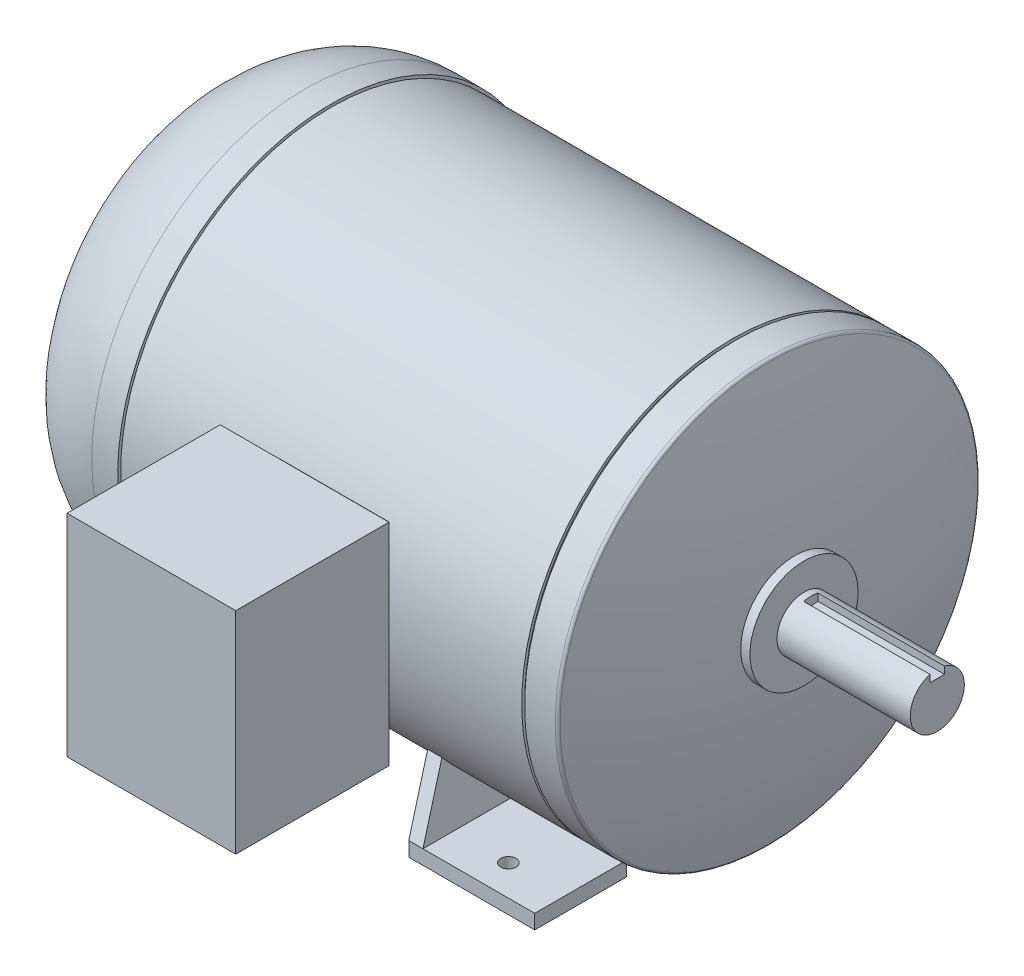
ISO-10303-21;
HEADER;
FILE_DESCRIPTION(('STEP AP214'),'2;1');
FILE_NAME('part.step','',(''),(''),'','','');
FILE_SCHEMA(('AUTOMOTIVE_DESIGN { 1 0 10303 214 1 1 1 1 }'));
ENDSEC;
DATA;
#1=APPLICATION_CONTEXT('core data for automotive mechanical design processes');
#2=APPLICATION_PROTOCOL_DEFINITION('international standard','automotive_design',2000,#1);
#3=PRODUCT_CONTEXT('',#1,'mechanical');
#4=PRODUCT('Part','Part','',(#3));
#5=PRODUCT_RELATED_PRODUCT_CATEGORY('part','',(#4));
#6=PRODUCT_DEFINITION_FORMATION('','',#4);
#7=PRODUCT_DEFINITION_CONTEXT('part definition',#1,'design');
#8=PRODUCT_DEFINITION('design','',#6,#7);
#9=PRODUCT_DEFINITION_SHAPE('','',#8);
#10=(LENGTH_UNIT() NAMED_UNIT(*) SI_UNIT(.MILLI.,.METRE.));
#11=(NAMED_UNIT(*) PLANE_ANGLE_UNIT() SI_UNIT($,.RADIAN.));
#12=(NAMED_UNIT(*) SI_UNIT($,.STERADIAN.) SOLID_ANGLE_UNIT());
#13=UNCERTAINTY_MEASURE_WITH_UNIT(LENGTH_MEASURE(1.E-05),#10,'distance_accuracy_value','');
#14=(GEOMETRIC_REPRESENTATION_CONTEXT(3) GLOBAL_UNCERTAINTY_ASSIGNED_CONTEXT((#13)) GLOBAL_UNIT_ASSIGNED_CONTEXT((#10,
#11,#12)) REPRESENTATION_CONTEXT('',''));
#15=CARTESIAN_POINT('',(0.,0.,0.));
#16=DIRECTION('',(0.,0.,1.));
#17=DIRECTION('',(1.,0.,0.));
#18=AXIS2_PLACEMENT_3D('',#15,#16,#17);
#19=CARTESIAN_POINT('',(-432.943,92.86875,-2.22044604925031E-13));
#20=DIRECTION('',(-1.,0.,0.));
#21=DIRECTION('',(0.,0.,1.));
#22=AXIS2_PLACEMENT_3D('',#19,#20,#21);
#23=PLANE('',#22);
#24=DIRECTION('',(0.,-1.,0.));
#25=VECTOR('',#24,1.);
#26=CARTESIAN_POINT('',(-432.943,92.86875,198.4375));
#27=LINE('',#26,#25);
#28=CARTESIAN_POINT('',(-432.943,92.86875,198.4375));
#29=VERTEX_POINT('',#28);
#30=CARTESIAN_POINT('',(-432.943,-92.86875,198.4375));
#31=VERTEX_POINT('',#30);
#32=EDGE_CURVE('P0_E108',#29,#31,#27,.T.);
#33=ORIENTED_EDGE('',*,*,#32,.T.);
#34=DIRECTION('',(0.,0.,1.));
#35=VECTOR('',#34,1.);
#36=CARTESIAN_POINT('',(-432.943,-92.86875,-2.22044604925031E-13));
#37=LINE('',#36,#35);
#38=CARTESIAN_POINT('',(-432.943,-92.86875,333.375));
#39=VERTEX_POINT('',#38);
#40=EDGE_CURVE('P0_E131',#31,#39,#37,.T.);
#41=ORIENTED_EDGE('',*,*,#40,.T.);
#42=DIRECTION('',(0.,-1.,0.));
#43=VECTOR('',#42,1.);
#44=CARTESIAN_POINT('',(-432.943,92.86875,333.375));
#45=LINE('',#44,#43);
#46=CARTESIAN_POINT('',(-432.943,92.86875,333.375));
#47=VERTEX_POINT('',#46);
#48=EDGE_CURVE('P0_E119',#47,#39,#45,.T.);
#49=ORIENTED_EDGE('',*,*,#48,.F.);
#50=DIRECTION('',(0.,0.,1.));
#51=VECTOR('',#50,1.);
#52=CARTESIAN_POINT('',(-432.943,92.86875,-2.22044604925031E-13));
#53=LINE('',#52,#51);
#54=EDGE_CURVE('P0_E132',#29,#47,#53,.T.);
#55=ORIENTED_EDGE('',*,*,#54,.F.);
#56=EDGE_LOOP('',(#33,#41,#49,#55));
#57=FACE_BOUND('',#56,.T.);
#58=ADVANCED_FACE('P0_F17',(#57),#23,.T.);
#59=CARTESIAN_POINT('',(-432.943,92.86875,-2.22044604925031E-13));
#60=DIRECTION('',(0.,1.,0.));
#61=DIRECTION('',(0.,0.,1.));
#62=AXIS2_PLACEMENT_3D('',#59,#60,#61);
#63=PLANE('',#62);
#64=DIRECTION('',(-1.,0.,0.));
#65=VECTOR('',#64,1.);
#66=CARTESIAN_POINT('',(-432.943,92.86875,198.4375));
#67=LINE('',#66,#65);
#68=CARTESIAN_POINT('',(-284.353,92.86875,198.4375));
#69=VERTEX_POINT('',#68);
#70=EDGE_CURVE('P0_E116',#69,#29,#67,.T.);
#71=ORIENTED_EDGE('',*,*,#70,.T.);
#72=ORIENTED_EDGE('',*,*,#54,.T.);
#73=DIRECTION('',(-1.,0.,0.));
#74=VECTOR('',#73,1.);
#75=CARTESIAN_POINT('',(-432.943,92.86875,333.375));
#76=LINE('',#75,#74);
#77=CARTESIAN_POINT('',(-284.353,92.86875,333.375));
#78=VERTEX_POINT('',#77);
#79=EDGE_CURVE('P0_E128',#78,#47,#76,.T.);
#80=ORIENTED_EDGE('',*,*,#79,.F.);
#81=DIRECTION('',(0.,0.,1.));
#82=VECTOR('',#81,1.);
#83=CARTESIAN_POINT('',(-284.353,92.86875,-2.22044604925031E-13));
#84=LINE('',#83,#82);
#85=EDGE_CURVE('P0_E134',#69,#78,#84,.T.);
#86=ORIENTED_EDGE('',*,*,#85,.F.);
#87=EDGE_LOOP('',(#71,#72,#80,#86));
#88=FACE_BOUND('',#87,.T.);
#89=ADVANCED_FACE('P0_F165',(#88),#63,.T.);
#90=CARTESIAN_POINT('',(-284.353,92.86875,-2.22044604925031E-13));
#91=DIRECTION('',(1.,0.,0.));
#92=DIRECTION('',(0.,0.,-1.));
#93=AXIS2_PLACEMENT_3D('',#90,#91,#92);
#94=PLANE('',#93);
#95=DIRECTION('',(0.,1.,0.));
#96=VECTOR('',#95,1.);
#97=CARTESIAN_POINT('',(-284.353,92.86875,198.4375));
#98=LINE('',#97,#96);
#99=CARTESIAN_POINT('',(-284.353,-92.86875,198.4375));
#100=VERTEX_POINT('',#99);
#101=EDGE_CURVE('P0_E31',#100,#69,#98,.T.);
#102=ORIENTED_EDGE('',*,*,#101,.T.);
#103=ORIENTED_EDGE('',*,*,#85,.T.);
#104=DIRECTION('',(0.,1.,0.));
#105=VECTOR('',#104,1.);
#106=CARTESIAN_POINT('',(-284.353,92.86875,333.375));
#107=LINE('',#106,#105);
#108=CARTESIAN_POINT('',(-284.353,-92.86875,333.375));
#109=VERTEX_POINT('',#108);
#110=EDGE_CURVE('P0_E125',#109,#78,#107,.T.);
#111=ORIENTED_EDGE('',*,*,#110,.F.);
#112=DIRECTION('',(0.,0.,1.));
#113=VECTOR('',#112,1.);
#114=CARTESIAN_POINT('',(-284.353,-92.86875,-2.22044604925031E-13));
#115=LINE('',#114,#113);
#116=EDGE_CURVE('P0_E136',#100,#109,#115,.T.);
#117=ORIENTED_EDGE('',*,*,#116,.F.);
#118=EDGE_LOOP('',(#102,#103,#111,#117));
#119=FACE_BOUND('',#118,.T.);
#120=ADVANCED_FACE('P0_F171',(#119),#94,.T.);
#121=CARTESIAN_POINT('',(-432.943,-92.86875,-2.22044604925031E-13));
#122=DIRECTION('',(0.,-1.,0.));
#123=DIRECTION('',(0.,0.,-1.));
#124=AXIS2_PLACEMENT_3D('',#121,#122,#123);
#125=PLANE('',#124);
#126=CARTESIAN_POINT('',(-358.648,-92.86875,265.90625));
#127=DIRECTION('',(0.,-1.,0.));
#128=DIRECTION('',(0.,0.,-1.));
#129=AXIS2_PLACEMENT_3D('',#126,#127,#128);
#130=CIRCLE('',#129,19.05);
#131=CARTESIAN_POINT('',(-358.648,-92.86875,246.85625));
#132=VERTEX_POINT('',#131);
#133=EDGE_CURVE('P0_E218',#132,#132,#130,.T.);
#134=ORIENTED_EDGE('',*,*,#133,.F.);
#135=EDGE_LOOP('',(#134));
#136=FACE_BOUND('',#135,.T.);
#137=DIRECTION('',(1.,0.,0.));
#138=VECTOR('',#137,1.);
#139=CARTESIAN_POINT('',(-432.943,-92.86875,198.4375));
#140=LINE('',#139,#138);
#141=EDGE_CURVE('P0_E113',#31,#100,#140,.T.);
#142=ORIENTED_EDGE('',*,*,#141,.T.);
#143=ORIENTED_EDGE('',*,*,#116,.T.);
#144=DIRECTION('',(1.,0.,0.));
#145=VECTOR('',#144,1.);
#146=CARTESIAN_POINT('',(-432.943,-92.86875,333.375));
#147=LINE('',#146,#145);
#148=EDGE_CURVE('P0_E122',#39,#109,#147,.T.);
#149=ORIENTED_EDGE('',*,*,#148,.F.);
#150=ORIENTED_EDGE('',*,*,#40,.F.);
#151=EDGE_LOOP('',(#142,#143,#149,#150));
#152=FACE_BOUND('',#151,.T.);
#153=ADVANCED_FACE('P0_F179',(#136,#152),#125,.T.);
#154=CARTESIAN_POINT('',(-432.943,-92.86875,333.375));
#155=DIRECTION('',(0.,0.,1.));
#156=DIRECTION('',(1.,0.,0.));
#157=AXIS2_PLACEMENT_3D('',#154,#155,#156);
#158=PLANE('',#157);
#159=ORIENTED_EDGE('',*,*,#48,.T.);
#160=ORIENTED_EDGE('',*,*,#148,.T.);
#161=ORIENTED_EDGE('',*,*,#110,.T.);
#162=ORIENTED_EDGE('',*,*,#79,.T.);
#163=EDGE_LOOP('',(#159,#160,#161,#162));
#164=FACE_BOUND('',#163,.T.);
#165=ADVANCED_FACE('P0_F183',(#164),#158,.T.);
#166=CARTESIAN_POINT('',(-309.753,67.46875,-188.2775));
#167=DIRECTION('',(0.,1.,0.));
#168=DIRECTION('',(0.,0.,1.));
#169=AXIS2_PLACEMENT_3D('',#166,#167,#168);
#170=PLANE('',#169);
#171=DIRECTION('',(-1.,0.,0.));
#172=VECTOR('',#171,1.);
#173=CARTESIAN_POINT('',(-432.943,67.4687500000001,-2.22044604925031E-13));
#174=LINE('',#173,#172);
#175=CARTESIAN_POINT('',(-309.753,67.46875,-2.22044604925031E-13));
#176=VERTEX_POINT('',#175);
#177=CARTESIAN_POINT('',(-407.543,67.46875,-2.22044604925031E-13));
#178=VERTEX_POINT('',#177);
#179=EDGE_CURVE('P0_E11',#176,#178,#174,.T.);
#180=ORIENTED_EDGE('',*,*,#179,.T.);
#181=DIRECTION('',(0.,0.,1.));
#182=VECTOR('',#181,1.);
#183=CARTESIAN_POINT('',(-407.543,67.46875,-188.2775));
#184=LINE('',#183,#182);
#185=CARTESIAN_POINT('',(-407.543,67.46875,198.4375));
#186=VERTEX_POINT('',#185);
#187=EDGE_CURVE('P0_E39',#178,#186,#184,.T.);
#188=ORIENTED_EDGE('',*,*,#187,.T.);
#189=DIRECTION('',(-1.,0.,0.));
#190=VECTOR('',#189,1.);
#191=CARTESIAN_POINT('',(-309.753,67.46875,198.4375));
#192=LINE('',#191,#190);
#193=CARTESIAN_POINT('',(-309.753,67.46875,198.4375));
#194=VERTEX_POINT('',#193);
#195=EDGE_CURVE('P0_E97',#194,#186,#192,.T.);
#196=ORIENTED_EDGE('',*,*,#195,.F.);
#197=DIRECTION('',(0.,0.,1.));
#198=VECTOR('',#197,1.);
#199=CARTESIAN_POINT('',(-309.753,67.46875,-188.2775));
#200=LINE('',#199,#198);
#201=EDGE_CURVE('P0_E106',#176,#194,#200,.T.);
#202=ORIENTED_EDGE('',*,*,#201,.F.);
#203=EDGE_LOOP('',(#180,#188,#196,#202));
#204=FACE_BOUND('',#203,.T.);
#205=ADVANCED_FACE('P0_F148',(#204),#170,.T.);
#206=CARTESIAN_POINT('',(-309.753,-67.46875,-188.2775));
#207=DIRECTION('',(1.,0.,0.));
#208=DIRECTION('',(0.,0.,-1.));
#209=AXIS2_PLACEMENT_3D('',#206,#207,#208);
#210=PLANE('',#209);
#211=DIRECTION('',(0.,1.,0.));
#212=VECTOR('',#211,1.);
#213=CARTESIAN_POINT('',(-309.753,-92.86875,-2.22044604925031E-13));
#214=LINE('',#213,#212);
#215=CARTESIAN_POINT('',(-309.753,-67.46875,-2.22044604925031E-13));
#216=VERTEX_POINT('',#215);
#217=EDGE_CURVE('P0_E24',#216,#176,#214,.T.);
#218=ORIENTED_EDGE('',*,*,#217,.T.);
#219=ORIENTED_EDGE('',*,*,#201,.T.);
#220=DIRECTION('',(0.,1.,0.));
#221=VECTOR('',#220,1.);
#222=CARTESIAN_POINT('',(-309.753,-67.46875,198.4375));
#223=LINE('',#222,#221);
#224=CARTESIAN_POINT('',(-309.753,-67.46875,198.4375));
#225=VERTEX_POINT('',#224);
#226=EDGE_CURVE('P0_E101',#225,#194,#223,.T.);
#227=ORIENTED_EDGE('',*,*,#226,.F.);
#228=DIRECTION('',(0.,0.,1.));
#229=VECTOR('',#228,1.);
#230=CARTESIAN_POINT('',(-309.753,-67.46875,-188.2775));
#231=LINE('',#230,#229);
#232=EDGE_CURVE('P0_E87',#216,#225,#231,.T.);
#233=ORIENTED_EDGE('',*,*,#232,.F.);
#234=EDGE_LOOP('',(#218,#219,#227,#233));
#235=FACE_BOUND('',#234,.T.);
#236=ADVANCED_FACE('P0_F144',(#235),#210,.T.);
#237=CARTESIAN_POINT('',(-407.543,-67.46875,-188.2775));
#238=DIRECTION('',(0.,-1.,0.));
#239=DIRECTION('',(0.,0.,-1.));
#240=AXIS2_PLACEMENT_3D('',#237,#238,#239);
#241=PLANE('',#240);
#242=DIRECTION('',(1.,0.,0.));
#243=VECTOR('',#242,1.);
#244=CARTESIAN_POINT('',(-432.943,-67.46875,-2.22044604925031E-13));
#245=LINE('',#244,#243);
#246=CARTESIAN_POINT('',(-407.543,-67.46875,-2.22044604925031E-13));
#247=VERTEX_POINT('',#246);
#248=EDGE_CURVE('P0_E140',#247,#216,#245,.T.);
#249=ORIENTED_EDGE('',*,*,#248,.T.);
#250=ORIENTED_EDGE('',*,*,#232,.T.);
#251=DIRECTION('',(1.,0.,0.));
#252=VECTOR('',#251,1.);
#253=CARTESIAN_POINT('',(-407.543,-67.46875,198.4375));
#254=LINE('',#253,#252);
#255=CARTESIAN_POINT('',(-407.543,-67.46875,198.4375));
#256=VERTEX_POINT('',#255);
#257=EDGE_CURVE('P0_E94',#256,#225,#254,.T.);
#258=ORIENTED_EDGE('',*,*,#257,.F.);
#259=DIRECTION('',(0.,0.,1.));
#260=VECTOR('',#259,1.);
#261=CARTESIAN_POINT('',(-407.543,-67.46875,-188.2775));
#262=LINE('',#261,#260);
#263=EDGE_CURVE('P0_E78',#247,#256,#262,.T.);
#264=ORIENTED_EDGE('',*,*,#263,.F.);
#265=EDGE_LOOP('',(#249,#250,#258,#264));
#266=FACE_BOUND('',#265,.T.);
#267=ADVANCED_FACE('P0_F99',(#266),#241,.T.);
#268=CARTESIAN_POINT('',(-407.543,67.46875,-188.2775));
#269=DIRECTION('',(-1.,0.,0.));
#270=DIRECTION('',(0.,0.,1.));
#271=AXIS2_PLACEMENT_3D('',#268,#269,#270);
#272=PLANE('',#271);
#273=DIRECTION('',(0.,-1.,0.));
#274=VECTOR('',#273,1.);
#275=CARTESIAN_POINT('',(-407.543,-92.86875,-2.22044604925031E-13));
#276=LINE('',#275,#274);
#277=EDGE_CURVE('P0_E83',#178,#247,#276,.T.);
#278=ORIENTED_EDGE('',*,*,#277,.T.);
#279=ORIENTED_EDGE('',*,*,#263,.T.);
#280=DIRECTION('',(0.,-1.,0.));
#281=VECTOR('',#280,1.);
#282=CARTESIAN_POINT('',(-407.543,67.46875,198.4375));
#283=LINE('',#282,#281);
#284=EDGE_CURVE('P0_E81',#186,#256,#283,.T.);
#285=ORIENTED_EDGE('',*,*,#284,.F.);
#286=ORIENTED_EDGE('',*,*,#187,.F.);
#287=EDGE_LOOP('',(#278,#279,#285,#286));
#288=FACE_BOUND('',#287,.T.);
#289=ADVANCED_FACE('P0_F80',(#288),#272,.T.);
#290=CARTESIAN_POINT('',(-432.943,-92.86875,198.4375));
#291=DIRECTION('',(0.,0.,1.));
#292=DIRECTION('',(1.,0.,0.));
#293=AXIS2_PLACEMENT_3D('',#290,#291,#292);
#294=PLANE('',#293);
#295=ORIENTED_EDGE('',*,*,#195,.T.);
#296=ORIENTED_EDGE('',*,*,#284,.T.);
#297=ORIENTED_EDGE('',*,*,#257,.T.);
#298=ORIENTED_EDGE('',*,*,#226,.T.);
#299=EDGE_LOOP('',(#295,#296,#297,#298));
#300=FACE_BOUND('',#299,.T.);
#301=ORIENTED_EDGE('',*,*,#32,.F.);
#302=ORIENTED_EDGE('',*,*,#70,.F.);
#303=ORIENTED_EDGE('',*,*,#101,.F.);
#304=ORIENTED_EDGE('',*,*,#141,.F.);
#305=EDGE_LOOP('',(#301,#302,#303,#304));
#306=FACE_BOUND('',#305,.T.);
#307=ADVANCED_FACE('P0_F92',(#300,#306),#294,.F.);
#308=CARTESIAN_POINT('',(-432.943,-92.86875,-2.22044604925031E-13));
#309=DIRECTION('',(0.,0.,1.));
#310=DIRECTION('',(1.,0.,0.));
#311=AXIS2_PLACEMENT_3D('',#308,#309,#310);
#312=PLANE('',#311);
#313=ORIENTED_EDGE('',*,*,#179,.F.);
#314=ORIENTED_EDGE('',*,*,#217,.F.);
#315=ORIENTED_EDGE('',*,*,#248,.F.);
#316=ORIENTED_EDGE('',*,*,#277,.F.);
#317=EDGE_LOOP('',(#313,#314,#315,#316));
#318=FACE_BOUND('',#317,.T.);
#319=ADVANCED_FACE('P0_F149',(#318),#312,.F.);
#320=CARTESIAN_POINT('',(-358.648,0.,265.90625));
#321=DIRECTION('',(0.,-1.,0.));
#322=DIRECTION('',(0.,0.,-1.));
#323=AXIS2_PLACEMENT_3D('',#320,#321,#322);
#324=CYLINDRICAL_SURFACE('',#323,19.05);
#325=CARTESIAN_POINT('',(-358.648,0.,265.90625));
#326=DIRECTION('',(0.,-1.,0.));
#327=DIRECTION('',(0.,0.,-1.));
#328=AXIS2_PLACEMENT_3D('',#325,#326,#327);
#329=CIRCLE('',#328,19.05);
#330=CARTESIAN_POINT('',(-358.648,0.,246.85625));
#331=VERTEX_POINT('',#330);
#332=EDGE_CURVE('P0_E217',#331,#331,#329,.T.);
#333=ORIENTED_EDGE('',*,*,#332,.F.);
#334=EDGE_LOOP('',(#333));
#335=FACE_BOUND('',#334,.T.);
#336=ORIENTED_EDGE('',*,*,#133,.T.);
#337=EDGE_LOOP('',(#336));
#338=FACE_BOUND('',#337,.T.);
#339=ADVANCED_FACE('P0_F151',(#335,#338),#324,.F.);
#340=CARTESIAN_POINT('',(-358.648,0.,265.90625));
#341=DIRECTION('',(0.,-1.,0.));
#342=DIRECTION('',(0.,0.,-1.));
#343=AXIS2_PLACEMENT_3D('',#340,#341,#342);
#344=PLANE('',#343);
#345=ORIENTED_EDGE('',*,*,#332,.T.);
#346=EDGE_LOOP('',(#345));
#347=FACE_BOUND('',#346,.T.);
#348=ADVANCED_FACE('P0_F159',(#347),#344,.T.);
#349=CLOSED_SHELL('',(#58,#89,#120,#153,#165,#205,#236,#267,#289,#307,#319,#339,#348));
#350=MANIFOLD_SOLID_BREP('P0_B1',#349);
#351=CARTESIAN_POINT('',(-286.258,-173.0375,-292.207688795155));
#352=DIRECTION('',(0.,-1.,0.));
#353=DIRECTION('',(0.,0.,-1.));
#354=AXIS2_PLACEMENT_3D('',#351,#352,#353);
#355=PLANE('',#354);
#356=DIRECTION('',(0.,0.,1.));
#357=VECTOR('',#356,1.);
#358=CARTESIAN_POINT('',(-418.530941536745,-173.0375,-188.2775));
#359=LINE('',#358,#357);
#360=CARTESIAN_POINT('',(-418.530941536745,-173.0375,-166.624));
#361=VERTEX_POINT('',#360);
#362=CARTESIAN_POINT('',(-418.530941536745,-173.0375,-85.8520000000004));
#363=VERTEX_POINT('',#362);
#364=EDGE_CURVE('P1_E32',#361,#363,#359,.T.);
#365=ORIENTED_EDGE('',*,*,#364,.T.);
#366=DIRECTION('',(-1.,0.,0.));
#367=VECTOR('',#366,1.);
#368=CARTESIAN_POINT('',(-286.258,-173.0375,-85.8520000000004));
#369=LINE('',#368,#367);
#370=CARTESIAN_POINT('',(-431.038,-173.0375,-85.8520000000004));
#371=VERTEX_POINT('',#370);
#372=EDGE_CURVE('P1_E76',#363,#371,#369,.T.);
#373=ORIENTED_EDGE('',*,*,#372,.T.);
#374=DIRECTION('',(0.,0.,1.));
#375=VECTOR('',#374,1.);
#376=CARTESIAN_POINT('',(-431.038,-173.0375,-292.207688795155));
#377=LINE('',#376,#375);
#378=CARTESIAN_POINT('',(-431.038,-173.0375,-166.624));
#379=VERTEX_POINT('',#378);
#380=EDGE_CURVE('P1_E74',#379,#371,#377,.T.);
#381=ORIENTED_EDGE('',*,*,#380,.F.);
#382=DIRECTION('',(-1.,0.,0.));
#383=VECTOR('',#382,1.);
#384=CARTESIAN_POINT('',(-286.258,-173.0375,-166.624));
#385=LINE('',#384,#383);
#386=EDGE_CURVE('P1_E69',#361,#379,#385,.T.);
#387=ORIENTED_EDGE('',*,*,#386,.F.);
#388=EDGE_LOOP('',(#365,#373,#381,#387));
#389=FACE_BOUND('',#388,.T.);
#390=ADVANCED_FACE('P1_F17',(#389),#355,.T.);
#391=CARTESIAN_POINT('',(-286.258,-153.609196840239,-156.984709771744));
#392=DIRECTION('',(0.,-0.444450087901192,0.895803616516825));
#393=DIRECTION('',(0.,-0.895803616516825,-0.444450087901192));
#394=AXIS2_PLACEMENT_3D('',#391,#392,#393);
#395=PLANE('',#394);
#396=DIRECTION('',(-0.156020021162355,-0.884833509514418,-0.439007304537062));
#397=VECTOR('',#396,1.);
#398=CARTESIAN_POINT('',(-424.171385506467,-134.094994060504,-147.302800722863));
#399=LINE('',#398,#397);
#400=CARTESIAN_POINT('',(-400.526820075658,0.,-80.7720000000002));
#401=VERTEX_POINT('',#400);
#402=EDGE_CURVE('P1_E39',#401,#379,#399,.T.);
#403=ORIENTED_EDGE('',*,*,#402,.F.);
#404=DIRECTION('',(-1.,0.,0.));
#405=VECTOR('',#404,1.);
#406=CARTESIAN_POINT('',(-286.258,0.,-80.7720000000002));
#407=LINE('',#406,#405);
#408=CARTESIAN_POINT('',(-388.019761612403,0.,-80.7720000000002));
#409=VERTEX_POINT('',#408);
#410=EDGE_CURVE('P1_E67',#409,#401,#407,.T.);
#411=ORIENTED_EDGE('',*,*,#410,.F.);
#412=DIRECTION('',(-0.156020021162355,-0.884833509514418,-0.439007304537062));
#413=VECTOR('',#412,1.);
#414=CARTESIAN_POINT('',(-411.968776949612,-135.821615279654,-148.159458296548));
#415=LINE('',#414,#413);
#416=EDGE_CURVE('P1_E11',#409,#361,#415,.T.);
#417=ORIENTED_EDGE('',*,*,#416,.T.);
#418=ORIENTED_EDGE('',*,*,#386,.T.);
#419=EDGE_LOOP('',(#403,#411,#417,#418));
#420=FACE_BOUND('',#419,.T.);
#421=ADVANCED_FACE('P1_F66',(#420),#395,.F.);
#422=CARTESIAN_POINT('',(-286.258,-185.767760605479,-92.1680779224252));
#423=DIRECTION('',(0.,0.444450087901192,-0.895803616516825));
#424=DIRECTION('',(0.,0.895803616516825,0.444450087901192));
#425=AXIS2_PLACEMENT_3D('',#422,#423,#424);
#426=PLANE('',#425);
#427=DIRECTION('',(0.156020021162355,0.884833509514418,0.439007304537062));
#428=VECTOR('',#427,1.);
#429=CARTESIAN_POINT('',(-429.703777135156,-165.470746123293,-82.0977793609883));
#430=LINE('',#429,#428);
#431=CARTESIAN_POINT('',(-400.526820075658,0.,-2.22044604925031E-13));
#432=VERTEX_POINT('',#431);
#433=EDGE_CURVE('P1_E58',#371,#432,#430,.T.);
#434=ORIENTED_EDGE('',*,*,#433,.F.);
#435=ORIENTED_EDGE('',*,*,#372,.F.);
#436=DIRECTION('',(0.156020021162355,0.884833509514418,0.439007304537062));
#437=VECTOR('',#436,1.);
#438=CARTESIAN_POINT('',(-417.501168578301,-167.197367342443,-82.9544369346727));
#439=LINE('',#438,#437);
#440=CARTESIAN_POINT('',(-388.019761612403,0.,-2.22044604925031E-13));
#441=VERTEX_POINT('',#440);
#442=EDGE_CURVE('P1_E78',#363,#441,#439,.T.);
#443=ORIENTED_EDGE('',*,*,#442,.T.);
#444=DIRECTION('',(-1.,0.,0.));
#445=VECTOR('',#444,1.);
#446=CARTESIAN_POINT('',(-286.258,0.,-2.22044604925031E-13));
#447=LINE('',#446,#445);
#448=EDGE_CURVE('P1_E25',#441,#432,#447,.T.);
#449=ORIENTED_EDGE('',*,*,#448,.T.);
#450=EDGE_LOOP('',(#434,#435,#443,#449));
#451=FACE_BOUND('',#450,.T.);
#452=ADVANCED_FACE('P1_F85',(#451),#426,.F.);
#453=CARTESIAN_POINT('',(-286.258,0.,-292.207688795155));
#454=DIRECTION('',(0.,1.,0.));
#455=DIRECTION('',(0.,0.,1.));
#456=AXIS2_PLACEMENT_3D('',#453,#454,#455);
#457=PLANE('',#456);
#458=ORIENTED_EDGE('',*,*,#410,.T.);
#459=DIRECTION('',(0.,0.,1.));
#460=VECTOR('',#459,1.);
#461=CARTESIAN_POINT('',(-400.526820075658,0.,-188.2775));
#462=LINE('',#461,#460);
#463=EDGE_CURVE('P1_E55',#401,#432,#462,.T.);
#464=ORIENTED_EDGE('',*,*,#463,.T.);
#465=ORIENTED_EDGE('',*,*,#448,.F.);
#466=DIRECTION('',(0.,0.,1.));
#467=VECTOR('',#466,1.);
#468=CARTESIAN_POINT('',(-388.019761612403,0.,-188.2775));
#469=LINE('',#468,#467);
#470=EDGE_CURVE('P1_E73',#409,#441,#469,.T.);
#471=ORIENTED_EDGE('',*,*,#470,.F.);
#472=EDGE_LOOP('',(#458,#464,#465,#471));
#473=FACE_BOUND('',#472,.T.);
#474=ADVANCED_FACE('P1_F19',(#473),#457,.T.);
#475=CARTESIAN_POINT('',(-446.494473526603,-260.695517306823,-188.2775));
#476=DIRECTION('',(-0.984807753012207,0.173648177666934,0.));
#477=DIRECTION('',(-0.173648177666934,-0.984807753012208,0.));
#478=AXIS2_PLACEMENT_3D('',#475,#476,#477);
#479=PLANE('',#478);
#480=ORIENTED_EDGE('',*,*,#433,.T.);
#481=ORIENTED_EDGE('',*,*,#463,.F.);
#482=ORIENTED_EDGE('',*,*,#402,.T.);
#483=ORIENTED_EDGE('',*,*,#380,.T.);
#484=EDGE_LOOP('',(#480,#481,#482,#483));
#485=FACE_BOUND('',#484,.T.);
#486=ADVANCED_FACE('P1_F56',(#485),#479,.T.);
#487=CARTESIAN_POINT('',(-434.364549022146,-262.834350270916,-188.2775));
#488=DIRECTION('',(-0.984807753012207,0.173648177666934,0.));
#489=DIRECTION('',(-0.173648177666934,-0.984807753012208,0.));
#490=AXIS2_PLACEMENT_3D('',#487,#488,#489);
#491=PLANE('',#490);
#492=ORIENTED_EDGE('',*,*,#364,.F.);
#493=ORIENTED_EDGE('',*,*,#416,.F.);
#494=ORIENTED_EDGE('',*,*,#470,.T.);
#495=ORIENTED_EDGE('',*,*,#442,.F.);
#496=EDGE_LOOP('',(#492,#493,#494,#495));
#497=FACE_BOUND('',#496,.T.);
#498=ADVANCED_FACE('P1_F109',(#497),#491,.F.);
#499=CLOSED_SHELL('',(#390,#421,#452,#474,#486,#498));
#500=MANIFOLD_SOLID_BREP('P1_B1',#499);
#501=CARTESIAN_POINT('',(-286.258,0.,-292.207688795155));
#502=DIRECTION('',(0.,1.,0.));
#503=DIRECTION('',(0.,0.,1.));
#504=AXIS2_PLACEMENT_3D('',#501,#502,#503);
#505=PLANE('',#504);
#506=DIRECTION('',(-1.,0.,0.));
#507=VECTOR('',#506,1.);
#508=CARTESIAN_POINT('',(-286.258,0.,-80.7720000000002));
#509=LINE('',#508,#507);
#510=CARTESIAN_POINT('',(-316.769179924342,0.,-80.7720000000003));
#511=VERTEX_POINT('',#510);
#512=CARTESIAN_POINT('',(-329.276238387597,0.,-80.7720000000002));
#513=VERTEX_POINT('',#512);
#514=EDGE_CURVE('P2_E20',#511,#513,#509,.T.);
#515=ORIENTED_EDGE('',*,*,#514,.T.);
#516=DIRECTION('',(0.,0.,1.));
#517=VECTOR('',#516,1.);
#518=CARTESIAN_POINT('',(-329.276238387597,0.,-188.2775));
#519=LINE('',#518,#517);
#520=CARTESIAN_POINT('',(-329.276238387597,0.,-2.22044604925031E-13));
#521=VERTEX_POINT('',#520);
#522=EDGE_CURVE('P2_E75',#513,#521,#519,.T.);
#523=ORIENTED_EDGE('',*,*,#522,.T.);
#524=DIRECTION('',(-1.,0.,0.));
#525=VECTOR('',#524,1.);
#526=CARTESIAN_POINT('',(-286.258,0.,-2.22044604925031E-13));
#527=LINE('',#526,#525);
#528=CARTESIAN_POINT('',(-316.769179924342,0.,-2.22044604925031E-13));
#529=VERTEX_POINT('',#528);
#530=EDGE_CURVE('P2_E70',#529,#521,#527,.T.);
#531=ORIENTED_EDGE('',*,*,#530,.F.);
#532=DIRECTION('',(0.,0.,1.));
#533=VECTOR('',#532,1.);
#534=CARTESIAN_POINT('',(-316.769179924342,0.,-188.2775));
#535=LINE('',#534,#533);
#536=EDGE_CURVE('P2_E51',#511,#529,#535,.T.);
#537=ORIENTED_EDGE('',*,*,#536,.F.);
#538=EDGE_LOOP('',(#515,#523,#531,#537));
#539=FACE_BOUND('',#538,.T.);
#540=ADVANCED_FACE('P2_F17',(#539),#505,.T.);
#541=CARTESIAN_POINT('',(-286.258,-185.767760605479,-92.1680779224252));
#542=DIRECTION('',(0.,0.444450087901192,-0.895803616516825));
#543=DIRECTION('',(0.,0.895803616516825,0.444450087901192));
#544=AXIS2_PLACEMENT_3D('',#541,#542,#543);
#545=PLANE('',#544);
#546=DIRECTION('',(-0.156020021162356,0.884833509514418,0.439007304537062));
#547=VECTOR('',#546,1.);
#548=CARTESIAN_POINT('',(-296.270560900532,-187.184498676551,-92.8709879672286));
#549=LINE('',#548,#547);
#550=CARTESIAN_POINT('',(-298.765058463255,-173.0375,-85.8520000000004));
#551=VERTEX_POINT('',#550);
#552=EDGE_CURVE('P2_E71',#551,#521,#549,.T.);
#553=ORIENTED_EDGE('',*,*,#552,.F.);
#554=DIRECTION('',(-1.,0.,0.));
#555=VECTOR('',#554,1.);
#556=CARTESIAN_POINT('',(-286.258,-173.0375,-85.8520000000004));
#557=LINE('',#556,#555);
#558=CARTESIAN_POINT('',(-286.258,-173.0375,-85.8520000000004));
#559=VERTEX_POINT('',#558);
#560=EDGE_CURVE('P2_E63',#559,#551,#557,.T.);
#561=ORIENTED_EDGE('',*,*,#560,.F.);
#562=DIRECTION('',(-0.156020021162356,0.884833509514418,0.439007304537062));
#563=VECTOR('',#562,1.);
#564=CARTESIAN_POINT('',(-284.067952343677,-185.457877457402,-92.0143303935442));
#565=LINE('',#564,#563);
#566=EDGE_CURVE('P2_E76',#559,#529,#565,.T.);
#567=ORIENTED_EDGE('',*,*,#566,.T.);
#568=ORIENTED_EDGE('',*,*,#530,.T.);
#569=EDGE_LOOP('',(#553,#561,#567,#568));
#570=FACE_BOUND('',#569,.T.);
#571=ADVANCED_FACE('P2_F87',(#570),#545,.F.);
#572=CARTESIAN_POINT('',(-286.258,-173.0375,-292.207688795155));
#573=DIRECTION('',(0.,-1.,0.));
#574=DIRECTION('',(0.,0.,-1.));
#575=AXIS2_PLACEMENT_3D('',#572,#573,#574);
#576=PLANE('',#575);
#577=DIRECTION('',(0.,0.,1.));
#578=VECTOR('',#577,1.);
#579=CARTESIAN_POINT('',(-298.765058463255,-173.0375,-188.2775));
#580=LINE('',#579,#578);
#581=CARTESIAN_POINT('',(-298.765058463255,-173.0375,-166.624));
#582=VERTEX_POINT('',#581);
#583=EDGE_CURVE('P2_E11',#582,#551,#580,.T.);
#584=ORIENTED_EDGE('',*,*,#583,.F.);
#585=DIRECTION('',(-1.,0.,0.));
#586=VECTOR('',#585,1.);
#587=CARTESIAN_POINT('',(-286.258,-173.0375,-166.624));
#588=LINE('',#587,#586);
#589=CARTESIAN_POINT('',(-286.258,-173.0375,-166.624));
#590=VERTEX_POINT('',#589);
#591=EDGE_CURVE('P2_E62',#590,#582,#588,.T.);
#592=ORIENTED_EDGE('',*,*,#591,.F.);
#593=DIRECTION('',(0.,0.,1.));
#594=VECTOR('',#593,1.);
#595=CARTESIAN_POINT('',(-286.258,-173.0375,-292.207688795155));
#596=LINE('',#595,#594);
#597=EDGE_CURVE('P2_E57',#590,#559,#596,.T.);
#598=ORIENTED_EDGE('',*,*,#597,.T.);
#599=ORIENTED_EDGE('',*,*,#560,.T.);
#600=EDGE_LOOP('',(#584,#592,#598,#599));
#601=FACE_BOUND('',#600,.T.);
#602=ADVANCED_FACE('P2_F84',(#601),#576,.T.);
#603=CARTESIAN_POINT('',(-286.258,-153.609196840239,-156.984709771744));
#604=DIRECTION('',(0.,-0.444450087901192,0.895803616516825));
#605=DIRECTION('',(0.,-0.895803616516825,-0.444450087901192));
#606=AXIS2_PLACEMENT_3D('',#603,#604,#605);
#607=PLANE('',#606);
#608=DIRECTION('',(0.156020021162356,-0.884833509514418,-0.439007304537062));
#609=VECTOR('',#608,1.);
#610=CARTESIAN_POINT('',(-301.802952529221,-155.808746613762,-158.076009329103));
#611=LINE('',#610,#609);
#612=EDGE_CURVE('P2_E26',#513,#582,#611,.T.);
#613=ORIENTED_EDGE('',*,*,#612,.F.);
#614=ORIENTED_EDGE('',*,*,#514,.F.);
#615=DIRECTION('',(0.156020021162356,-0.884833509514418,-0.439007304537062));
#616=VECTOR('',#615,1.);
#617=CARTESIAN_POINT('',(-289.600343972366,-154.082125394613,-157.219351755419));
#618=LINE('',#617,#616);
#619=EDGE_CURVE('P2_E54',#511,#590,#618,.T.);
#620=ORIENTED_EDGE('',*,*,#619,.T.);
#621=ORIENTED_EDGE('',*,*,#591,.T.);
#622=EDGE_LOOP('',(#613,#614,#620,#621));
#623=FACE_BOUND('',#622,.T.);
#624=ADVANCED_FACE('P2_F74',(#623),#607,.F.);
#625=CARTESIAN_POINT('',(-270.801526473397,-260.695517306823,-188.2775));
#626=DIRECTION('',(-0.984807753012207,-0.173648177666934,0.));
#627=DIRECTION('',(0.173648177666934,-0.984807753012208,0.));
#628=AXIS2_PLACEMENT_3D('',#625,#626,#627);
#629=PLANE('',#628);
#630=ORIENTED_EDGE('',*,*,#597,.F.);
#631=ORIENTED_EDGE('',*,*,#619,.F.);
#632=ORIENTED_EDGE('',*,*,#536,.T.);
#633=ORIENTED_EDGE('',*,*,#566,.F.);
#634=EDGE_LOOP('',(#630,#631,#632,#633));
#635=FACE_BOUND('',#634,.T.);
#636=ADVANCED_FACE('P2_F55',(#635),#629,.F.);
#637=CARTESIAN_POINT('',(-282.931450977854,-262.834350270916,-188.2775));
#638=DIRECTION('',(-0.984807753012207,-0.173648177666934,0.));
#639=DIRECTION('',(0.173648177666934,-0.984807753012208,0.));
#640=AXIS2_PLACEMENT_3D('',#637,#638,#639);
#641=PLANE('',#640);
#642=ORIENTED_EDGE('',*,*,#552,.T.);
#643=ORIENTED_EDGE('',*,*,#522,.F.);
#644=ORIENTED_EDGE('',*,*,#612,.T.);
#645=ORIENTED_EDGE('',*,*,#583,.T.);
#646=EDGE_LOOP('',(#642,#643,#644,#645));
#647=FACE_BOUND('',#646,.T.);
#648=ADVANCED_FACE('P2_F91',(#647),#641,.T.);
#649=CLOSED_SHELL('',(#540,#571,#602,#624,#636,#648));
#650=MANIFOLD_SOLID_BREP('P2_B1',#649);
#651=CARTESIAN_POINT('',(-286.258,46.9113755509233,-23.2749283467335));
#652=DIRECTION('',(0.,-0.444450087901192,-0.895803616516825));
#653=DIRECTION('',(0.,0.895803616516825,-0.444450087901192));
#654=AXIS2_PLACEMENT_3D('',#651,#652,#653);
#655=PLANE('',#654);
#656=DIRECTION('',(-1.,0.,0.));
#657=VECTOR('',#656,1.);
#658=CARTESIAN_POINT('',(-286.258,-173.0375,85.8519999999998));
#659=LINE('',#658,#657);
#660=CARTESIAN_POINT('',(-286.258,-173.0375,85.8519999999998));
#661=VERTEX_POINT('',#660);
#662=CARTESIAN_POINT('',(-298.765058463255,-173.0375,85.8519999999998));
#663=VERTEX_POINT('',#662);
#664=EDGE_CURVE('P3_E20',#661,#663,#659,.T.);
#665=ORIENTED_EDGE('',*,*,#664,.T.);
#666=DIRECTION('',(-0.156020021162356,0.884833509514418,-0.439007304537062));
#667=VECTOR('',#666,1.);
#668=CARTESIAN_POINT('',(-336.29946624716,39.8307044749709,-19.7618761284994));
#669=LINE('',#668,#667);
#670=CARTESIAN_POINT('',(-329.276238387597,0.,-2.22044604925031E-13));
#671=VERTEX_POINT('',#670);
#672=EDGE_CURVE('P3_E35',#663,#671,#669,.T.);
#673=ORIENTED_EDGE('',*,*,#672,.T.);
#674=DIRECTION('',(-1.,0.,0.));
#675=VECTOR('',#674,1.);
#676=CARTESIAN_POINT('',(-286.258,0.,-2.22044604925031E-13));
#677=LINE('',#676,#675);
#678=CARTESIAN_POINT('',(-316.769179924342,0.,-2.22044604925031E-13));
#679=VERTEX_POINT('',#678);
#680=EDGE_CURVE('P3_E70',#679,#671,#677,.T.);
#681=ORIENTED_EDGE('',*,*,#680,.F.);
#682=DIRECTION('',(-0.156020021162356,0.884833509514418,-0.439007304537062));
#683=VECTOR('',#682,1.);
#684=CARTESIAN_POINT('',(-324.096857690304,41.5573256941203,-20.6185337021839));
#685=LINE('',#684,#683);
#686=EDGE_CURVE('P3_E56',#661,#679,#685,.T.);
#687=ORIENTED_EDGE('',*,*,#686,.F.);
#688=EDGE_LOOP('',(#665,#673,#681,#687));
#689=FACE_BOUND('',#688,.T.);
#690=ADVANCED_FACE('P3_F17',(#689),#655,.T.);
#691=CARTESIAN_POINT('',(-286.258,0.,-292.207688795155));
#692=DIRECTION('',(0.,1.,0.));
#693=DIRECTION('',(0.,0.,1.));
#694=AXIS2_PLACEMENT_3D('',#691,#692,#693);
#695=PLANE('',#694);
#696=ORIENTED_EDGE('',*,*,#680,.T.);
#697=DIRECTION('',(0.,0.,1.));
#698=VECTOR('',#697,1.);
#699=CARTESIAN_POINT('',(-329.276238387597,0.,-188.2775));
#700=LINE('',#699,#698);
#701=CARTESIAN_POINT('',(-329.276238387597,0.,80.7719999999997));
#702=VERTEX_POINT('',#701);
#703=EDGE_CURVE('P3_E74',#671,#702,#700,.T.);
#704=ORIENTED_EDGE('',*,*,#703,.T.);
#705=DIRECTION('',(-1.,0.,0.));
#706=VECTOR('',#705,1.);
#707=CARTESIAN_POINT('',(-286.258,0.,80.7719999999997));
#708=LINE('',#707,#706);
#709=CARTESIAN_POINT('',(-316.769179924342,0.,80.7719999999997));
#710=VERTEX_POINT('',#709);
#711=EDGE_CURVE('P3_E72',#710,#702,#708,.T.);
#712=ORIENTED_EDGE('',*,*,#711,.F.);
#713=DIRECTION('',(0.,0.,1.));
#714=VECTOR('',#713,1.);
#715=CARTESIAN_POINT('',(-316.769179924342,0.,-188.2775));
#716=LINE('',#715,#714);
#717=EDGE_CURVE('P3_E53',#679,#710,#716,.T.);
#718=ORIENTED_EDGE('',*,*,#717,.F.);
#719=EDGE_LOOP('',(#696,#704,#712,#718));
#720=FACE_BOUND('',#719,.T.);
#721=ADVANCED_FACE('P3_F68',(#720),#695,.T.);
#722=CARTESIAN_POINT('',(-286.258,79.0699393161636,41.5417035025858));
#723=DIRECTION('',(0.,0.444450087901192,0.895803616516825));
#724=DIRECTION('',(0.,-0.895803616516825,0.444450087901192));
#725=AXIS2_PLACEMENT_3D('',#722,#723,#724);
#726=PLANE('',#725);
#727=ORIENTED_EDGE('',*,*,#711,.T.);
#728=DIRECTION('',(0.156020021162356,-0.884833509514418,0.439007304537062));
#729=VECTOR('',#728,1.);
#730=CARTESIAN_POINT('',(-341.831857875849,71.2064565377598,45.4431452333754));
#731=LINE('',#730,#729);
#732=CARTESIAN_POINT('',(-298.765058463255,-173.0375,166.624));
#733=VERTEX_POINT('',#732);
#734=EDGE_CURVE('P3_E79',#702,#733,#731,.T.);
#735=ORIENTED_EDGE('',*,*,#734,.T.);
#736=DIRECTION('',(-1.,0.,0.));
#737=VECTOR('',#736,1.);
#738=CARTESIAN_POINT('',(-286.258,-173.0375,166.624));
#739=LINE('',#738,#737);
#740=CARTESIAN_POINT('',(-286.258,-173.0375,166.624));
#741=VERTEX_POINT('',#740);
#742=EDGE_CURVE('P3_E80',#741,#733,#739,.T.);
#743=ORIENTED_EDGE('',*,*,#742,.F.);
#744=DIRECTION('',(0.156020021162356,-0.884833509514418,0.439007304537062));
#745=VECTOR('',#744,1.);
#746=CARTESIAN_POINT('',(-329.629249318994,72.9330777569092,44.5864876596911));
#747=LINE('',#746,#745);
#748=EDGE_CURVE('P3_E26',#710,#741,#747,.T.);
#749=ORIENTED_EDGE('',*,*,#748,.F.);
#750=EDGE_LOOP('',(#727,#735,#743,#749));
#751=FACE_BOUND('',#750,.T.);
#752=ADVANCED_FACE('P3_F89',(#751),#726,.T.);
#753=CARTESIAN_POINT('',(-286.258,-173.0375,-292.207688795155));
#754=DIRECTION('',(0.,1.,0.));
#755=DIRECTION('',(0.,0.,1.));
#756=AXIS2_PLACEMENT_3D('',#753,#754,#755);
#757=PLANE('',#756);
#758=ORIENTED_EDGE('',*,*,#742,.T.);
#759=DIRECTION('',(0.,0.,-1.));
#760=VECTOR('',#759,1.);
#761=CARTESIAN_POINT('',(-298.765058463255,-173.0375,-292.207688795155));
#762=LINE('',#761,#760);
#763=EDGE_CURVE('P3_E63',#733,#663,#762,.T.);
#764=ORIENTED_EDGE('',*,*,#763,.T.);
#765=ORIENTED_EDGE('',*,*,#664,.F.);
#766=DIRECTION('',(0.,0.,-1.));
#767=VECTOR('',#766,1.);
#768=CARTESIAN_POINT('',(-286.258,-173.0375,-292.207688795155));
#769=LINE('',#768,#767);
#770=EDGE_CURVE('P3_E11',#741,#661,#769,.T.);
#771=ORIENTED_EDGE('',*,*,#770,.F.);
#772=EDGE_LOOP('',(#758,#764,#765,#771));
#773=FACE_BOUND('',#772,.T.);
#774=ADVANCED_FACE('P3_F90',(#773),#757,.F.);
#775=CARTESIAN_POINT('',(-270.801526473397,-260.695517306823,-188.2775));
#776=DIRECTION('',(-0.984807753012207,-0.173648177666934,0.));
#777=DIRECTION('',(0.173648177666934,-0.984807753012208,0.));
#778=AXIS2_PLACEMENT_3D('',#775,#776,#777);
#779=PLANE('',#778);
#780=ORIENTED_EDGE('',*,*,#686,.T.);
#781=ORIENTED_EDGE('',*,*,#717,.T.);
#782=ORIENTED_EDGE('',*,*,#748,.T.);
#783=ORIENTED_EDGE('',*,*,#770,.T.);
#784=EDGE_LOOP('',(#780,#781,#782,#783));
#785=FACE_BOUND('',#784,.T.);
#786=ADVANCED_FACE('P3_F57',(#785),#779,.F.);
#787=CARTESIAN_POINT('',(-282.931450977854,-262.834350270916,-188.2775));
#788=DIRECTION('',(-0.984807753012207,-0.173648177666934,0.));
#789=DIRECTION('',(0.173648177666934,-0.984807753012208,0.));
#790=AXIS2_PLACEMENT_3D('',#787,#788,#789);
#791=PLANE('',#790);
#792=ORIENTED_EDGE('',*,*,#763,.F.);
#793=ORIENTED_EDGE('',*,*,#734,.F.);
#794=ORIENTED_EDGE('',*,*,#703,.F.);
#795=ORIENTED_EDGE('',*,*,#672,.F.);
#796=EDGE_LOOP('',(#792,#793,#794,#795));
#797=FACE_BOUND('',#796,.T.);
#798=ADVANCED_FACE('P3_F91',(#797),#791,.T.);
#799=CLOSED_SHELL('',(#690,#721,#752,#774,#786,#798));
#800=MANIFOLD_SOLID_BREP('P3_B1',#799);
#801=CARTESIAN_POINT('',(-286.258,-173.0375,-292.207688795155));
#802=DIRECTION('',(0.,1.,0.));
#803=DIRECTION('',(0.,0.,1.));
#804=AXIS2_PLACEMENT_3D('',#801,#802,#803);
#805=PLANE('',#804);
#806=DIRECTION('',(-1.,0.,0.));
#807=VECTOR('',#806,1.);
#808=CARTESIAN_POINT('',(-286.258,-173.0375,85.8519999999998));
#809=LINE('',#808,#807);
#810=CARTESIAN_POINT('',(-418.530941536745,-173.0375,85.8519999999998));
#811=VERTEX_POINT('',#810);
#812=CARTESIAN_POINT('',(-431.038,-173.0375,85.8519999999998));
#813=VERTEX_POINT('',#812);
#814=EDGE_CURVE('P4_E69',#811,#813,#809,.T.);
#815=ORIENTED_EDGE('',*,*,#814,.F.);
#816=DIRECTION('',(0.,0.,1.));
#817=VECTOR('',#816,1.);
#818=CARTESIAN_POINT('',(-418.530941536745,-173.0375,-292.207688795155));
#819=LINE('',#818,#817);
#820=CARTESIAN_POINT('',(-418.530941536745,-173.0375,166.624));
#821=VERTEX_POINT('',#820);
#822=EDGE_CURVE('P4_E11',#811,#821,#819,.T.);
#823=ORIENTED_EDGE('',*,*,#822,.T.);
#824=DIRECTION('',(-1.,0.,0.));
#825=VECTOR('',#824,1.);
#826=CARTESIAN_POINT('',(-286.258,-173.0375,166.624));
#827=LINE('',#826,#825);
#828=CARTESIAN_POINT('',(-431.038,-173.0375,166.624));
#829=VERTEX_POINT('',#828);
#830=EDGE_CURVE('P4_E75',#821,#829,#827,.T.);
#831=ORIENTED_EDGE('',*,*,#830,.T.);
#832=DIRECTION('',(0.,0.,-1.));
#833=VECTOR('',#832,1.);
#834=CARTESIAN_POINT('',(-431.038,-173.0375,-292.207688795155));
#835=LINE('',#834,#833);
#836=EDGE_CURVE('P4_E81',#829,#813,#835,.T.);
#837=ORIENTED_EDGE('',*,*,#836,.T.);
#838=EDGE_LOOP('',(#815,#823,#831,#837));
#839=FACE_BOUND('',#838,.T.);
#840=ADVANCED_FACE('P4_F17',(#839),#805,.F.);
#841=CARTESIAN_POINT('',(-286.258,79.0699393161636,41.5417035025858));
#842=DIRECTION('',(0.,0.444450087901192,0.895803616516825));
#843=DIRECTION('',(0.,-0.895803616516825,0.444450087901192));
#844=AXIS2_PLACEMENT_3D('',#841,#842,#843);
#845=PLANE('',#844);
#846=DIRECTION('',(-1.,0.,0.));
#847=VECTOR('',#846,1.);
#848=CARTESIAN_POINT('',(-286.258,0.,80.7719999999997));
#849=LINE('',#848,#847);
#850=CARTESIAN_POINT('',(-388.019761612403,0.,80.7719999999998));
#851=VERTEX_POINT('',#850);
#852=CARTESIAN_POINT('',(-400.526820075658,0.,80.7719999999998));
#853=VERTEX_POINT('',#852);
#854=EDGE_CURVE('P4_E74',#851,#853,#849,.T.);
#855=ORIENTED_EDGE('',*,*,#854,.T.);
#856=DIRECTION('',(-0.156020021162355,-0.884833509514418,0.439007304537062));
#857=VECTOR('',#856,1.);
#858=CARTESIAN_POINT('',(-384.142480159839,92.9202090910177,34.6699366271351));
#859=LINE('',#858,#857);
#860=EDGE_CURVE('P4_E58',#853,#829,#859,.T.);
#861=ORIENTED_EDGE('',*,*,#860,.T.);
#862=ORIENTED_EDGE('',*,*,#830,.F.);
#863=DIRECTION('',(-0.156020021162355,-0.884833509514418,0.439007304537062));
#864=VECTOR('',#863,1.);
#865=CARTESIAN_POINT('',(-371.939871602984,91.1935878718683,35.5265942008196));
#866=LINE('',#865,#864);
#867=EDGE_CURVE('P4_E32',#851,#821,#866,.T.);
#868=ORIENTED_EDGE('',*,*,#867,.F.);
#869=EDGE_LOOP('',(#855,#861,#862,#868));
#870=FACE_BOUND('',#869,.T.);
#871=ADVANCED_FACE('P4_F90',(#870),#845,.T.);
#872=CARTESIAN_POINT('',(-286.258,0.,-292.207688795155));
#873=DIRECTION('',(0.,1.,0.));
#874=DIRECTION('',(0.,0.,1.));
#875=AXIS2_PLACEMENT_3D('',#872,#873,#874);
#876=PLANE('',#875);
#877=DIRECTION('',(-1.,0.,0.));
#878=VECTOR('',#877,1.);
#879=CARTESIAN_POINT('',(-286.258,0.,-2.22044604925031E-13));
#880=LINE('',#879,#878);
#881=CARTESIAN_POINT('',(-388.019761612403,0.,-2.22044604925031E-13));
#882=VERTEX_POINT('',#881);
#883=CARTESIAN_POINT('',(-400.526820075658,0.,-2.22044604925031E-13));
#884=VERTEX_POINT('',#883);
#885=EDGE_CURVE('P4_E25',#882,#884,#880,.T.);
#886=ORIENTED_EDGE('',*,*,#885,.T.);
#887=DIRECTION('',(0.,0.,1.));
#888=VECTOR('',#887,1.);
#889=CARTESIAN_POINT('',(-400.526820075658,0.,-188.2775));
#890=LINE('',#889,#888);
#891=EDGE_CURVE('P4_E55',#884,#853,#890,.T.);
#892=ORIENTED_EDGE('',*,*,#891,.T.);
#893=ORIENTED_EDGE('',*,*,#854,.F.);
#894=DIRECTION('',(0.,0.,1.));
#895=VECTOR('',#894,1.);
#896=CARTESIAN_POINT('',(-388.019761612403,0.,-188.2775));
#897=LINE('',#896,#895);
#898=EDGE_CURVE('P4_E63',#882,#851,#897,.T.);
#899=ORIENTED_EDGE('',*,*,#898,.F.);
#900=EDGE_LOOP('',(#886,#892,#893,#899));
#901=FACE_BOUND('',#900,.T.);
#902=ADVANCED_FACE('P4_F73',(#901),#876,.T.);
#903=CARTESIAN_POINT('',(-286.258,46.9113755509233,-23.2749283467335));
#904=DIRECTION('',(0.,-0.444450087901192,-0.895803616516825));
#905=DIRECTION('',(0.,0.895803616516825,-0.444450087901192));
#906=AXIS2_PLACEMENT_3D('',#903,#904,#905);
#907=PLANE('',#906);
#908=ORIENTED_EDGE('',*,*,#814,.T.);
#909=DIRECTION('',(0.156020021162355,0.884833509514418,-0.439007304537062));
#910=VECTOR('',#909,1.);
#911=CARTESIAN_POINT('',(-389.674871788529,61.5444570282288,-30.5350847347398));
#912=LINE('',#911,#910);
#913=EDGE_CURVE('P4_E39',#813,#884,#912,.T.);
#914=ORIENTED_EDGE('',*,*,#913,.T.);
#915=ORIENTED_EDGE('',*,*,#885,.F.);
#916=DIRECTION('',(0.156020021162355,0.884833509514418,-0.439007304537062));
#917=VECTOR('',#916,1.);
#918=CARTESIAN_POINT('',(-377.472263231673,59.8178358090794,-29.6784271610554));
#919=LINE('',#918,#917);
#920=EDGE_CURVE('P4_E83',#811,#882,#919,.T.);
#921=ORIENTED_EDGE('',*,*,#920,.F.);
#922=EDGE_LOOP('',(#908,#914,#915,#921));
#923=FACE_BOUND('',#922,.T.);
#924=ADVANCED_FACE('P4_F19',(#923),#907,.T.);
#925=CARTESIAN_POINT('',(-446.494473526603,-260.695517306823,-188.2775));
#926=DIRECTION('',(-0.984807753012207,0.173648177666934,0.));
#927=DIRECTION('',(-0.173648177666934,-0.984807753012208,0.));
#928=AXIS2_PLACEMENT_3D('',#925,#926,#927);
#929=PLANE('',#928);
#930=ORIENTED_EDGE('',*,*,#836,.F.);
#931=ORIENTED_EDGE('',*,*,#860,.F.);
#932=ORIENTED_EDGE('',*,*,#891,.F.);
#933=ORIENTED_EDGE('',*,*,#913,.F.);
#934=EDGE_LOOP('',(#930,#931,#932,#933));
#935=FACE_BOUND('',#934,.T.);
#936=ADVANCED_FACE('P4_F56',(#935),#929,.T.);
#937=CARTESIAN_POINT('',(-434.364549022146,-262.834350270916,-188.2775));
#938=DIRECTION('',(-0.984807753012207,0.173648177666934,0.));
#939=DIRECTION('',(-0.173648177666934,-0.984807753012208,0.));
#940=AXIS2_PLACEMENT_3D('',#937,#938,#939);
#941=PLANE('',#940);
#942=ORIENTED_EDGE('',*,*,#920,.T.);
#943=ORIENTED_EDGE('',*,*,#898,.T.);
#944=ORIENTED_EDGE('',*,*,#867,.T.);
#945=ORIENTED_EDGE('',*,*,#822,.F.);
#946=EDGE_LOOP('',(#942,#943,#944,#945));
#947=FACE_BOUND('',#946,.T.);
#948=ADVANCED_FACE('P4_F87',(#947),#941,.F.);
#949=CLOSED_SHELL('',(#840,#871,#902,#924,#936,#948));
#950=MANIFOLD_SOLID_BREP('P4_B1',#949);
#951=CARTESIAN_POINT('',(-187.833,-173.0375,-166.624));
#952=DIRECTION('',(0.,0.,1.));
#953=DIRECTION('',(1.,0.,0.));
#954=AXIS2_PLACEMENT_3D('',#951,#952,#953);
#955=PLANE('',#954);
#956=DIRECTION('',(-1.,0.,0.));
#957=VECTOR('',#956,1.);
#958=CARTESIAN_POINT('',(-187.833,-185.7375,-166.624));
#959=LINE('',#958,#957);
#960=CARTESIAN_POINT('',(-187.833,-185.7375,-166.624));
#961=VERTEX_POINT('',#960);
#962=CARTESIAN_POINT('',(-298.765058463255,-185.7375,-166.624));
#963=VERTEX_POINT('',#962);
#964=EDGE_CURVE('P5_E20',#961,#963,#959,.T.);
#965=ORIENTED_EDGE('',*,*,#964,.T.);
#966=DIRECTION('',(0.,1.,0.));
#967=VECTOR('',#966,1.);
#968=CARTESIAN_POINT('',(-298.765058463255,-173.0375,-166.624));
#969=LINE('',#968,#967);
#970=CARTESIAN_POINT('',(-298.765058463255,-173.0375,-166.624));
#971=VERTEX_POINT('',#970);
#972=EDGE_CURVE('P5_E34',#963,#971,#969,.T.);
#973=ORIENTED_EDGE('',*,*,#972,.T.);
#974=DIRECTION('',(-1.,0.,0.));
#975=VECTOR('',#974,1.);
#976=CARTESIAN_POINT('',(-187.833,-173.0375,-166.624));
#977=LINE('',#976,#975);
#978=CARTESIAN_POINT('',(-187.833,-173.0375,-166.624));
#979=VERTEX_POINT('',#978);
#980=EDGE_CURVE('P5_E71',#979,#971,#977,.T.);
#981=ORIENTED_EDGE('',*,*,#980,.F.);
#982=DIRECTION('',(0.,-1.,0.));
#983=VECTOR('',#982,1.);
#984=CARTESIAN_POINT('',(-187.833,-173.0375,-166.624));
#985=LINE('',#984,#983);
#986=EDGE_CURVE('P5_E62',#979,#961,#985,.T.);
#987=ORIENTED_EDGE('',*,*,#986,.T.);
#988=EDGE_LOOP('',(#965,#973,#981,#987));
#989=FACE_BOUND('',#988,.T.);
#990=ADVANCED_FACE('P5_F17',(#989),#955,.F.);
#991=CARTESIAN_POINT('',(-529.463,-173.0375,-85.8520000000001));
#992=DIRECTION('',(0.,0.,-1.));
#993=DIRECTION('',(-1.,0.,0.));
#994=AXIS2_PLACEMENT_3D('',#991,#992,#993);
#995=PLANE('',#994);
#996=DIRECTION('',(1.,0.,0.));
#997=VECTOR('',#996,1.);
#998=CARTESIAN_POINT('',(-529.463,-173.0375,-85.8520000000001));
#999=LINE('',#998,#997);
#1000=CARTESIAN_POINT('',(-298.765058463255,-173.0375,-85.8520000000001));
#1001=VERTEX_POINT('',#1000);
#1002=CARTESIAN_POINT('',(-187.833,-173.0375,-85.8520000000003));
#1003=VERTEX_POINT('',#1002);
#1004=EDGE_CURVE('P5_E69',#1001,#1003,#999,.T.);
#1005=ORIENTED_EDGE('',*,*,#1004,.F.);
#1006=DIRECTION('',(0.,-1.,0.));
#1007=VECTOR('',#1006,1.);
#1008=CARTESIAN_POINT('',(-298.765058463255,-173.037500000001,-85.8520000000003));
#1009=LINE('',#1008,#1007);
#1010=CARTESIAN_POINT('',(-298.765058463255,-185.7375,-85.8520000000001));
#1011=VERTEX_POINT('',#1010);
#1012=EDGE_CURVE('P5_E53',#1001,#1011,#1009,.T.);
#1013=ORIENTED_EDGE('',*,*,#1012,.T.);
#1014=DIRECTION('',(1.,0.,0.));
#1015=VECTOR('',#1014,1.);
#1016=CARTESIAN_POINT('',(-529.463,-185.7375,-85.8520000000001));
#1017=LINE('',#1016,#1015);
#1018=CARTESIAN_POINT('',(-187.833,-185.7375,-85.8520000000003));
#1019=VERTEX_POINT('',#1018);
#1020=EDGE_CURVE('P5_E61',#1011,#1019,#1017,.T.);
#1021=ORIENTED_EDGE('',*,*,#1020,.T.);
#1022=DIRECTION('',(0.,-1.,0.));
#1023=VECTOR('',#1022,1.);
#1024=CARTESIAN_POINT('',(-187.833,-173.0375,-85.8520000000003));
#1025=LINE('',#1024,#1023);
#1026=EDGE_CURVE('P5_E26',#1003,#1019,#1025,.T.);
#1027=ORIENTED_EDGE('',*,*,#1026,.F.);
#1028=EDGE_LOOP('',(#1005,#1013,#1021,#1027));
#1029=FACE_BOUND('',#1028,.T.);
#1030=ADVANCED_FACE('P5_F73',(#1029),#995,.F.);
#1031=CARTESIAN_POINT('',(-529.463,-173.0375,-166.624));
#1032=DIRECTION('',(0.,1.,0.));
#1033=DIRECTION('',(0.,0.,1.));
#1034=AXIS2_PLACEMENT_3D('',#1031,#1032,#1033);
#1035=PLANE('',#1034);
#1036=DIRECTION('',(0.,0.,1.));
#1037=VECTOR('',#1036,1.);
#1038=CARTESIAN_POINT('',(-298.765058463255,-173.0375,-188.2775));
#1039=LINE('',#1038,#1037);
#1040=EDGE_CURVE('P5_E56',#971,#1001,#1039,.T.);
#1041=ORIENTED_EDGE('',*,*,#1040,.T.);
#1042=ORIENTED_EDGE('',*,*,#1004,.T.);
#1043=DIRECTION('',(0.,0.,-1.));
#1044=VECTOR('',#1043,1.);
#1045=CARTESIAN_POINT('',(-187.833,-173.0375,-85.8520000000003));
#1046=LINE('',#1045,#1044);
#1047=EDGE_CURVE('P5_E77',#1003,#979,#1046,.T.);
#1048=ORIENTED_EDGE('',*,*,#1047,.T.);
#1049=ORIENTED_EDGE('',*,*,#980,.T.);
#1050=EDGE_LOOP('',(#1041,#1042,#1048,#1049));
#1051=FACE_BOUND('',#1050,.T.);
#1052=CARTESIAN_POINT('',(-237.998,-173.0375,-139.7));
#1053=DIRECTION('',(0.,1.,0.));
#1054=DIRECTION('',(0.,0.,1.));
#1055=AXIS2_PLACEMENT_3D('',#1052,#1053,#1054);
#1056=CIRCLE('',#1055,6.73099999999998);
#1057=CARTESIAN_POINT('',(-237.998,-173.0375,-132.969));
#1058=VERTEX_POINT('',#1057);
#1059=EDGE_CURVE('P5_E11',#1058,#1058,#1056,.T.);
#1060=ORIENTED_EDGE('',*,*,#1059,.F.);
#1061=EDGE_LOOP('',(#1060));
#1062=FACE_BOUND('',#1061,.T.);
#1063=ADVANCED_FACE('P5_F66',(#1051,#1062),#1035,.T.);
#1064=CARTESIAN_POINT('',(-529.463,-185.7375,-166.624));
#1065=DIRECTION('',(0.,1.,0.));
#1066=DIRECTION('',(0.,0.,1.));
#1067=AXIS2_PLACEMENT_3D('',#1064,#1065,#1066);
#1068=PLANE('',#1067);
#1069=CARTESIAN_POINT('',(-237.998,-185.7375,-139.7));
#1070=DIRECTION('',(0.,1.,0.));
#1071=DIRECTION('',(0.,0.,1.));
#1072=AXIS2_PLACEMENT_3D('',#1069,#1070,#1071);
#1073=CIRCLE('',#1072,6.73099999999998);
#1074=CARTESIAN_POINT('',(-237.998,-185.7375,-132.969));
#1075=VERTEX_POINT('',#1074);
#1076=EDGE_CURVE('P5_E94',#1075,#1075,#1073,.T.);
#1077=ORIENTED_EDGE('',*,*,#1076,.T.);
#1078=EDGE_LOOP('',(#1077));
#1079=FACE_BOUND('',#1078,.T.);
#1080=ORIENTED_EDGE('',*,*,#1020,.F.);
#1081=DIRECTION('',(0.,0.,-1.));
#1082=VECTOR('',#1081,1.);
#1083=CARTESIAN_POINT('',(-298.765058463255,-185.7375,-166.624));
#1084=LINE('',#1083,#1082);
#1085=EDGE_CURVE('P5_E57',#1011,#963,#1084,.T.);
#1086=ORIENTED_EDGE('',*,*,#1085,.T.);
#1087=ORIENTED_EDGE('',*,*,#964,.F.);
#1088=DIRECTION('',(0.,0.,-1.));
#1089=VECTOR('',#1088,1.);
#1090=CARTESIAN_POINT('',(-187.833,-185.7375,-166.624));
#1091=LINE('',#1090,#1089);
#1092=EDGE_CURVE('P5_E82',#1019,#961,#1091,.T.);
#1093=ORIENTED_EDGE('',*,*,#1092,.F.);
#1094=EDGE_LOOP('',(#1080,#1086,#1087,#1093));
#1095=FACE_BOUND('',#1094,.T.);
#1096=ADVANCED_FACE('P5_F83',(#1079,#1095),#1068,.F.);
#1097=CARTESIAN_POINT('',(-187.833,-173.0375,-166.624));
#1098=DIRECTION('',(-1.,0.,0.));
#1099=DIRECTION('',(0.,0.,1.));
#1100=AXIS2_PLACEMENT_3D('',#1097,#1098,#1099);
#1101=PLANE('',#1100);
#1102=ORIENTED_EDGE('',*,*,#1092,.T.);
#1103=ORIENTED_EDGE('',*,*,#986,.F.);
#1104=ORIENTED_EDGE('',*,*,#1047,.F.);
#1105=ORIENTED_EDGE('',*,*,#1026,.T.);
#1106=EDGE_LOOP('',(#1102,#1103,#1104,#1105));
#1107=FACE_BOUND('',#1106,.T.);
#1108=ADVANCED_FACE('P5_F89',(#1107),#1101,.F.);
#1109=CARTESIAN_POINT('',(-237.998,-185.7375,-139.7));
#1110=DIRECTION('',(0.,1.,0.));
#1111=DIRECTION('',(0.,0.,1.));
#1112=AXIS2_PLACEMENT_3D('',#1109,#1110,#1111);
#1113=CYLINDRICAL_SURFACE('',#1112,6.73099999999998);
#1114=CARTESIAN_POINT('',(-237.998,-185.7375,-132.969));
#1115=CARTESIAN_POINT('',(-237.998,-185.605208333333,-132.969));
#1116=CARTESIAN_POINT('',(-237.998,-185.472916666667,-132.969));
#1117=CARTESIAN_POINT('',(-237.998,-185.208333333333,-132.969));
#1118=CARTESIAN_POINT('',(-237.998,-185.076041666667,-132.969));
#1119=CARTESIAN_POINT('',(-237.998,-184.811458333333,-132.969));
#1120=CARTESIAN_POINT('',(-237.998,-184.679166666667,-132.969));
#1121=CARTESIAN_POINT('',(-237.998,-184.414583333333,-132.969));
#1122=CARTESIAN_POINT('',(-237.998,-184.282291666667,-132.969));
#1123=CARTESIAN_POINT('',(-237.998,-184.017708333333,-132.969));
#1124=CARTESIAN_POINT('',(-237.998,-183.885416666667,-132.969));
#1125=CARTESIAN_POINT('',(-237.998,-183.620833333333,-132.969));
#1126=CARTESIAN_POINT('',(-237.998,-183.488541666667,-132.969));
#1127=CARTESIAN_POINT('',(-237.998,-183.223958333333,-132.969));
#1128=CARTESIAN_POINT('',(-237.998,-183.091666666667,-132.969));
#1129=CARTESIAN_POINT('',(-237.998,-182.827083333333,-132.969));
#1130=CARTESIAN_POINT('',(-237.998,-182.694791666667,-132.969));
#1131=CARTESIAN_POINT('',(-237.998,-182.430208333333,-132.969));
#1132=CARTESIAN_POINT('',(-237.998,-182.297916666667,-132.969));
#1133=CARTESIAN_POINT('',(-237.998,-182.033333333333,-132.969));
#1134=CARTESIAN_POINT('',(-237.998,-181.901041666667,-132.969));
#1135=CARTESIAN_POINT('',(-237.998,-181.636458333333,-132.969));
#1136=CARTESIAN_POINT('',(-237.998,-181.504166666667,-132.969));
#1137=CARTESIAN_POINT('',(-237.998,-181.239583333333,-132.969));
#1138=CARTESIAN_POINT('',(-237.998,-181.107291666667,-132.969));
#1139=CARTESIAN_POINT('',(-237.998,-180.842708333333,-132.969));
#1140=CARTESIAN_POINT('',(-237.998,-180.710416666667,-132.969));
#1141=CARTESIAN_POINT('',(-237.998,-180.445833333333,-132.969));
#1142=CARTESIAN_POINT('',(-237.998,-180.313541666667,-132.969));
#1143=CARTESIAN_POINT('',(-237.998,-180.048958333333,-132.969));
#1144=CARTESIAN_POINT('',(-237.998,-179.916666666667,-132.969));
#1145=CARTESIAN_POINT('',(-237.998,-179.652083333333,-132.969));
#1146=CARTESIAN_POINT('',(-237.998,-179.519791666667,-132.969));
#1147=CARTESIAN_POINT('',(-237.998,-179.255208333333,-132.969));
#1148=CARTESIAN_POINT('',(-237.998,-179.122916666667,-132.969));
#1149=CARTESIAN_POINT('',(-237.998,-178.858333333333,-132.969));
#1150=CARTESIAN_POINT('',(-237.998,-178.726041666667,-132.969));
#1151=CARTESIAN_POINT('',(-237.998,-178.461458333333,-132.969));
#1152=CARTESIAN_POINT('',(-237.998,-178.329166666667,-132.969));
#1153=CARTESIAN_POINT('',(-237.998,-178.064583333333,-132.969));
#1154=CARTESIAN_POINT('',(-237.998,-177.932291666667,-132.969));
#1155=CARTESIAN_POINT('',(-237.998,-177.667708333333,-132.969));
#1156=CARTESIAN_POINT('',(-237.998,-177.535416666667,-132.969));
#1157=CARTESIAN_POINT('',(-237.998,-177.270833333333,-132.969));
#1158=CARTESIAN_POINT('',(-237.998,-177.138541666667,-132.969));
#1159=CARTESIAN_POINT('',(-237.998,-176.873958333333,-132.969));
#1160=CARTESIAN_POINT('',(-237.998,-176.741666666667,-132.969));
#1161=CARTESIAN_POINT('',(-237.998,-176.477083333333,-132.969));
#1162=CARTESIAN_POINT('',(-237.998,-176.344791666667,-132.969));
#1163=CARTESIAN_POINT('',(-237.998,-176.080208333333,-132.969));
#1164=CARTESIAN_POINT('',(-237.998,-175.947916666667,-132.969));
#1165=CARTESIAN_POINT('',(-237.998,-175.683333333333,-132.969));
#1166=CARTESIAN_POINT('',(-237.998,-175.551041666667,-132.969));
#1167=CARTESIAN_POINT('',(-237.998,-175.286458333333,-132.969));
#1168=CARTESIAN_POINT('',(-237.998,-175.154166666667,-132.969));
#1169=CARTESIAN_POINT('',(-237.998,-174.889583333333,-132.969));
#1170=CARTESIAN_POINT('',(-237.998,-174.757291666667,-132.969));
#1171=CARTESIAN_POINT('',(-237.998,-174.492708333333,-132.969));
#1172=CARTESIAN_POINT('',(-237.998,-174.360416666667,-132.969));
#1173=CARTESIAN_POINT('',(-237.998,-174.095833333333,-132.969));
#1174=CARTESIAN_POINT('',(-237.998,-173.963541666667,-132.969));
#1175=CARTESIAN_POINT('',(-237.998,-173.698958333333,-132.969));
#1176=CARTESIAN_POINT('',(-237.998,-173.566666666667,-132.969));
#1177=CARTESIAN_POINT('',(-237.998,-173.302083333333,-132.969));
#1178=CARTESIAN_POINT('',(-237.998,-173.169791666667,-132.969));
#1179=CARTESIAN_POINT('',(-237.998,-173.0375,-132.969));
#1180=B_SPLINE_CURVE_WITH_KNOTS('',3,(#1114,#1115,#1116,#1117,#1118,#1119,#1120,#1121,#1122,
#1123,#1124,#1125,#1126,#1127,#1128,#1129,#1130,#1131,#1132,#1133,#1134,#1135,#1136,#1137,#1138,
#1139,#1140,#1141,#1142,#1143,#1144,#1145,#1146,#1147,#1148,#1149,#1150,#1151,#1152,#1153,#1154,
#1155,#1156,#1157,#1158,#1159,#1160,#1161,#1162,#1163,#1164,#1165,#1166,#1167,#1168,#1169,#1170,
#1171,#1172,#1173,#1174,#1175,#1176,#1177,#1178,#1179),.UNSPECIFIED.,.F.,.F.,(4,2,2,2,2,2,2,2,2,
2,2,2,2,2,2,2,2,2,2,2,2,2,2,2,2,2,2,2,2,2,2,2,4),(0.,0.396875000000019,0.79375000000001,
1.19062500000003,1.58750000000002,1.98437500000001,2.38125000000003,2.77812500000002,
3.17500000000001,3.57187500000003,3.96875000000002,4.36562500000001,4.76250000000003,
5.15937500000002,5.55625000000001,5.95312500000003,6.35000000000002,6.74687500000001,
7.14375000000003,7.54062500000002,7.93750000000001,8.33437500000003,8.73125000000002,
9.12812500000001,9.52500000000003,9.92187500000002,10.31875,10.715625,11.1125,11.509375,
11.90625,12.303125,12.7),.UNSPECIFIED.);
#1181=EDGE_CURVE('P5_BSEAM116',#1075,#1058,#1180,.T.);
#1182=ORIENTED_EDGE('',*,*,#1076,.F.);
#1183=ORIENTED_EDGE('',*,*,#1059,.T.);
#1184=ORIENTED_EDGE('',*,*,#1181,.T.);
#1185=ORIENTED_EDGE('',*,*,#1181,.F.);
#1186=EDGE_LOOP('',(#1182,#1184,#1183,#1185));
#1187=FACE_BOUND('',#1186,.T.);
#1188=ADVANCED_FACE('P5_F116',(#1187),#1113,.F.);
#1189=CARTESIAN_POINT('',(-298.765058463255,-276.185220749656,-188.2775));
#1190=DIRECTION('',(1.,0.,0.));
#1191=DIRECTION('',(0.,1.,0.));
#1192=AXIS2_PLACEMENT_3D('',#1189,#1190,#1191);
#1193=PLANE('',#1192);
#1194=ORIENTED_EDGE('',*,*,#1085,.F.);
#1195=ORIENTED_EDGE('',*,*,#1012,.F.);
#1196=ORIENTED_EDGE('',*,*,#1040,.F.);
#1197=ORIENTED_EDGE('',*,*,#972,.F.);
#1198=EDGE_LOOP('',(#1194,#1195,#1196,#1197));
#1199=FACE_BOUND('',#1198,.T.);
#1200=ADVANCED_FACE('P5_F55',(#1199),#1193,.F.);
#1201=CLOSED_SHELL('',(#990,#1030,#1063,#1096,#1108,#1188,#1200));
#1202=MANIFOLD_SOLID_BREP('P5_B1',#1201);
#1203=CARTESIAN_POINT('',(-529.463,-173.0375,85.8519999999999));
#1204=DIRECTION('',(0.,0.,1.));
#1205=DIRECTION('',(1.,0.,0.));
#1206=AXIS2_PLACEMENT_3D('',#1203,#1204,#1205);
#1207=PLANE('',#1206);
#1208=DIRECTION('',(-1.,0.,0.));
#1209=VECTOR('',#1208,1.);
#1210=CARTESIAN_POINT('',(-529.463,-185.7375,85.8519999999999));
#1211=LINE('',#1210,#1209);
#1212=CARTESIAN_POINT('',(-187.833,-185.7375,85.8519999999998));
#1213=VERTEX_POINT('',#1212);
#1214=CARTESIAN_POINT('',(-298.765058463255,-185.7375,85.8519999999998));
#1215=VERTEX_POINT('',#1214);
#1216=EDGE_CURVE('P6_E20',#1213,#1215,#1211,.T.);
#1217=ORIENTED_EDGE('',*,*,#1216,.T.);
#1218=DIRECTION('',(0.,1.,0.));
#1219=VECTOR('',#1218,1.);
#1220=CARTESIAN_POINT('',(-298.765058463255,-173.037500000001,85.8519999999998));
#1221=LINE('',#1220,#1219);
#1222=CARTESIAN_POINT('',(-298.765058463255,-173.0375,85.8519999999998));
#1223=VERTEX_POINT('',#1222);
#1224=EDGE_CURVE('P6_E33',#1215,#1223,#1221,.T.);
#1225=ORIENTED_EDGE('',*,*,#1224,.T.);
#1226=DIRECTION('',(-1.,0.,0.));
#1227=VECTOR('',#1226,1.);
#1228=CARTESIAN_POINT('',(-529.463,-173.0375,85.8519999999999));
#1229=LINE('',#1228,#1227);
#1230=CARTESIAN_POINT('',(-187.833,-173.0375,85.8519999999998));
#1231=VERTEX_POINT('',#1230);
#1232=EDGE_CURVE('P6_E69',#1231,#1223,#1229,.T.);
#1233=ORIENTED_EDGE('',*,*,#1232,.F.);
#1234=DIRECTION('',(0.,-1.,0.));
#1235=VECTOR('',#1234,1.);
#1236=CARTESIAN_POINT('',(-187.833,-173.0375,85.8519999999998));
#1237=LINE('',#1236,#1235);
#1238=EDGE_CURVE('P6_E60',#1231,#1213,#1237,.T.);
#1239=ORIENTED_EDGE('',*,*,#1238,.T.);
#1240=EDGE_LOOP('',(#1217,#1225,#1233,#1239));
#1241=FACE_BOUND('',#1240,.T.);
#1242=ADVANCED_FACE('P6_F17',(#1241),#1207,.F.);
#1243=CARTESIAN_POINT('',(-187.833,-173.0375,166.624));
#1244=DIRECTION('',(0.,0.,-1.));
#1245=DIRECTION('',(-1.,0.,0.));
#1246=AXIS2_PLACEMENT_3D('',#1243,#1244,#1245);
#1247=PLANE('',#1246);
#1248=DIRECTION('',(1.,0.,0.));
#1249=VECTOR('',#1248,1.);
#1250=CARTESIAN_POINT('',(-187.833,-173.0375,166.624));
#1251=LINE('',#1250,#1249);
#1252=CARTESIAN_POINT('',(-298.765058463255,-173.0375,166.624));
#1253=VERTEX_POINT('',#1252);
#1254=CARTESIAN_POINT('',(-187.833,-173.0375,166.624));
#1255=VERTEX_POINT('',#1254);
#1256=EDGE_CURVE('P6_E67',#1253,#1255,#1251,.T.);
#1257=ORIENTED_EDGE('',*,*,#1256,.F.);
#1258=DIRECTION('',(0.,-1.,0.));
#1259=VECTOR('',#1258,1.);
#1260=CARTESIAN_POINT('',(-298.765058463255,-173.0375,166.624));
#1261=LINE('',#1260,#1259);
#1262=CARTESIAN_POINT('',(-298.765058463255,-185.7375,166.624));
#1263=VERTEX_POINT('',#1262);
#1264=EDGE_CURVE('P6_E52',#1253,#1263,#1261,.T.);
#1265=ORIENTED_EDGE('',*,*,#1264,.T.);
#1266=DIRECTION('',(1.,0.,0.));
#1267=VECTOR('',#1266,1.);
#1268=CARTESIAN_POINT('',(-187.833,-185.7375,166.624));
#1269=LINE('',#1268,#1267);
#1270=CARTESIAN_POINT('',(-187.833,-185.7375,166.624));
#1271=VERTEX_POINT('',#1270);
#1272=EDGE_CURVE('P6_E59',#1263,#1271,#1269,.T.);
#1273=ORIENTED_EDGE('',*,*,#1272,.T.);
#1274=DIRECTION('',(0.,-1.,0.));
#1275=VECTOR('',#1274,1.);
#1276=CARTESIAN_POINT('',(-187.833,-173.0375,166.624));
#1277=LINE('',#1276,#1275);
#1278=EDGE_CURVE('P6_E73',#1255,#1271,#1277,.T.);
#1279=ORIENTED_EDGE('',*,*,#1278,.F.);
#1280=EDGE_LOOP('',(#1257,#1265,#1273,#1279));
#1281=FACE_BOUND('',#1280,.T.);
#1282=ADVANCED_FACE('P6_F71',(#1281),#1247,.F.);
#1283=CARTESIAN_POINT('',(-187.833,-173.0375,85.8519999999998));
#1284=DIRECTION('',(0.,-1.,0.));
#1285=DIRECTION('',(0.,0.,-1.));
#1286=AXIS2_PLACEMENT_3D('',#1283,#1284,#1285);
#1287=PLANE('',#1286);
#1288=ORIENTED_EDGE('',*,*,#1232,.T.);
#1289=DIRECTION('',(0.,0.,1.));
#1290=VECTOR('',#1289,1.);
#1291=CARTESIAN_POINT('',(-298.765058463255,-173.0375,-188.2775));
#1292=LINE('',#1291,#1290);
#1293=EDGE_CURVE('P6_E55',#1223,#1253,#1292,.T.);
#1294=ORIENTED_EDGE('',*,*,#1293,.T.);
#1295=ORIENTED_EDGE('',*,*,#1256,.T.);
#1296=DIRECTION('',(0.,0.,-1.));
#1297=VECTOR('',#1296,1.);
#1298=CARTESIAN_POINT('',(-187.833,-173.0375,166.624));
#1299=LINE('',#1298,#1297);
#1300=EDGE_CURVE('P6_E75',#1255,#1231,#1299,.T.);
#1301=ORIENTED_EDGE('',*,*,#1300,.T.);
#1302=EDGE_LOOP('',(#1288,#1294,#1295,#1301));
#1303=FACE_BOUND('',#1302,.T.);
#1304=CARTESIAN_POINT('',(-237.998,-173.0375,139.7));
#1305=DIRECTION('',(0.,1.,0.));
#1306=DIRECTION('',(0.,0.,1.));
#1307=AXIS2_PLACEMENT_3D('',#1304,#1305,#1306);
#1308=CIRCLE('',#1307,6.73099999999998);
#1309=CARTESIAN_POINT('',(-237.998,-173.0375,146.431));
#1310=VERTEX_POINT('',#1309);
#1311=EDGE_CURVE('P6_E26',#1310,#1310,#1308,.T.);
#1312=ORIENTED_EDGE('',*,*,#1311,.F.);
#1313=EDGE_LOOP('',(#1312));
#1314=FACE_BOUND('',#1313,.T.);
#1315=ADVANCED_FACE('P6_F64',(#1303,#1314),#1287,.F.);
#1316=CARTESIAN_POINT('',(-187.833,-185.7375,85.8519999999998));
#1317=DIRECTION('',(0.,-1.,0.));
#1318=DIRECTION('',(0.,0.,-1.));
#1319=AXIS2_PLACEMENT_3D('',#1316,#1317,#1318);
#1320=PLANE('',#1319);
#1321=DIRECTION('',(0.,0.,1.));
#1322=VECTOR('',#1321,1.);
#1323=CARTESIAN_POINT('',(-298.765058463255,-185.7375,85.8519999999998));
#1324=LINE('',#1323,#1322);
#1325=EDGE_CURVE('P6_E11',#1215,#1263,#1324,.T.);
#1326=ORIENTED_EDGE('',*,*,#1325,.F.);
#1327=ORIENTED_EDGE('',*,*,#1216,.F.);
#1328=DIRECTION('',(0.,0.,-1.));
#1329=VECTOR('',#1328,1.);
#1330=CARTESIAN_POINT('',(-187.833,-185.7375,85.8519999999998));
#1331=LINE('',#1330,#1329);
#1332=EDGE_CURVE('P6_E83',#1271,#1213,#1331,.T.);
#1333=ORIENTED_EDGE('',*,*,#1332,.F.);
#1334=ORIENTED_EDGE('',*,*,#1272,.F.);
#1335=EDGE_LOOP('',(#1326,#1327,#1333,#1334));
#1336=FACE_BOUND('',#1335,.T.);
#1337=CARTESIAN_POINT('',(-237.998,-185.7375,139.7));
#1338=DIRECTION('',(0.,1.,0.));
#1339=DIRECTION('',(0.,0.,1.));
#1340=AXIS2_PLACEMENT_3D('',#1337,#1338,#1339);
#1341=CIRCLE('',#1340,6.73099999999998);
#1342=CARTESIAN_POINT('',(-237.998,-185.7375,146.431));
#1343=VERTEX_POINT('',#1342);
#1344=EDGE_CURVE('P6_E77',#1343,#1343,#1341,.T.);
#1345=ORIENTED_EDGE('',*,*,#1344,.T.);
#1346=EDGE_LOOP('',(#1345));
#1347=FACE_BOUND('',#1346,.T.);
#1348=ADVANCED_FACE('P6_F84',(#1336,#1347),#1320,.T.);
#1349=CARTESIAN_POINT('',(-187.833,-173.0375,85.8519999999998));
#1350=DIRECTION('',(-1.,0.,0.));
#1351=DIRECTION('',(0.,0.,1.));
#1352=AXIS2_PLACEMENT_3D('',#1349,#1350,#1351);
#1353=PLANE('',#1352);
#1354=ORIENTED_EDGE('',*,*,#1332,.T.);
#1355=ORIENTED_EDGE('',*,*,#1238,.F.);
#1356=ORIENTED_EDGE('',*,*,#1300,.F.);
#1357=ORIENTED_EDGE('',*,*,#1278,.T.);
#1358=EDGE_LOOP('',(#1354,#1355,#1356,#1357));
#1359=FACE_BOUND('',#1358,.T.);
#1360=ADVANCED_FACE('P6_F91',(#1359),#1353,.F.);
#1361=CARTESIAN_POINT('',(-237.998,-185.7375,139.7));
#1362=DIRECTION('',(0.,1.,0.));
#1363=DIRECTION('',(0.,0.,1.));
#1364=AXIS2_PLACEMENT_3D('',#1361,#1362,#1363);
#1365=CYLINDRICAL_SURFACE('',#1364,6.73099999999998);
#1366=CARTESIAN_POINT('',(-237.998,-185.7375,146.431));
#1367=CARTESIAN_POINT('',(-237.998,-185.605208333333,146.431));
#1368=CARTESIAN_POINT('',(-237.998,-185.472916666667,146.431));
#1369=CARTESIAN_POINT('',(-237.998,-185.208333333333,146.431));
#1370=CARTESIAN_POINT('',(-237.998,-185.076041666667,146.431));
#1371=CARTESIAN_POINT('',(-237.998,-184.811458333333,146.431));
#1372=CARTESIAN_POINT('',(-237.998,-184.679166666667,146.431));
#1373=CARTESIAN_POINT('',(-237.998,-184.414583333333,146.431));
#1374=CARTESIAN_POINT('',(-237.998,-184.282291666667,146.431));
#1375=CARTESIAN_POINT('',(-237.998,-184.017708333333,146.431));
#1376=CARTESIAN_POINT('',(-237.998,-183.885416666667,146.431));
#1377=CARTESIAN_POINT('',(-237.998,-183.620833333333,146.431));
#1378=CARTESIAN_POINT('',(-237.998,-183.488541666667,146.431));
#1379=CARTESIAN_POINT('',(-237.998,-183.223958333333,146.431));
#1380=CARTESIAN_POINT('',(-237.998,-183.091666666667,146.431));
#1381=CARTESIAN_POINT('',(-237.998,-182.827083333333,146.431));
#1382=CARTESIAN_POINT('',(-237.998,-182.694791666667,146.431));
#1383=CARTESIAN_POINT('',(-237.998,-182.430208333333,146.431));
#1384=CARTESIAN_POINT('',(-237.998,-182.297916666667,146.431));
#1385=CARTESIAN_POINT('',(-237.998,-182.033333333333,146.431));
#1386=CARTESIAN_POINT('',(-237.998,-181.901041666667,146.431));
#1387=CARTESIAN_POINT('',(-237.998,-181.636458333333,146.431));
#1388=CARTESIAN_POINT('',(-237.998,-181.504166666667,146.431));
#1389=CARTESIAN_POINT('',(-237.998,-181.239583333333,146.431));
#1390=CARTESIAN_POINT('',(-237.998,-181.107291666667,146.431));
#1391=CARTESIAN_POINT('',(-237.998,-180.842708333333,146.431));
#1392=CARTESIAN_POINT('',(-237.998,-180.710416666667,146.431));
#1393=CARTESIAN_POINT('',(-237.998,-180.445833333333,146.431));
#1394=CARTESIAN_POINT('',(-237.998,-180.313541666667,146.431));
#1395=CARTESIAN_POINT('',(-237.998,-180.048958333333,146.431));
#1396=CARTESIAN_POINT('',(-237.998,-179.916666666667,146.431));
#1397=CARTESIAN_POINT('',(-237.998,-179.652083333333,146.431));
#1398=CARTESIAN_POINT('',(-237.998,-179.519791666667,146.431));
#1399=CARTESIAN_POINT('',(-237.998,-179.255208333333,146.431));
#1400=CARTESIAN_POINT('',(-237.998,-179.122916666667,146.431));
#1401=CARTESIAN_POINT('',(-237.998,-178.858333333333,146.431));
#1402=CARTESIAN_POINT('',(-237.998,-178.726041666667,146.431));
#1403=CARTESIAN_POINT('',(-237.998,-178.461458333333,146.431));
#1404=CARTESIAN_POINT('',(-237.998,-178.329166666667,146.431));
#1405=CARTESIAN_POINT('',(-237.998,-178.064583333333,146.431));
#1406=CARTESIAN_POINT('',(-237.998,-177.932291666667,146.431));
#1407=CARTESIAN_POINT('',(-237.998,-177.667708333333,146.431));
#1408=CARTESIAN_POINT('',(-237.998,-177.535416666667,146.431));
#1409=CARTESIAN_POINT('',(-237.998,-177.270833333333,146.431));
#1410=CARTESIAN_POINT('',(-237.998,-177.138541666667,146.431));
#1411=CARTESIAN_POINT('',(-237.998,-176.873958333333,146.431));
#1412=CARTESIAN_POINT('',(-237.998,-176.741666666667,146.431));
#1413=CARTESIAN_POINT('',(-237.998,-176.477083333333,146.431));
#1414=CARTESIAN_POINT('',(-237.998,-176.344791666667,146.431));
#1415=CARTESIAN_POINT('',(-237.998,-176.080208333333,146.431));
#1416=CARTESIAN_POINT('',(-237.998,-175.947916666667,146.431));
#1417=CARTESIAN_POINT('',(-237.998,-175.683333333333,146.431));
#1418=CARTESIAN_POINT('',(-237.998,-175.551041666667,146.431));
#1419=CARTESIAN_POINT('',(-237.998,-175.286458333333,146.431));
#1420=CARTESIAN_POINT('',(-237.998,-175.154166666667,146.431));
#1421=CARTESIAN_POINT('',(-237.998,-174.889583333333,146.431));
#1422=CARTESIAN_POINT('',(-237.998,-174.757291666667,146.431));
#1423=CARTESIAN_POINT('',(-237.998,-174.492708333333,146.431));
#1424=CARTESIAN_POINT('',(-237.998,-174.360416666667,146.431));
#1425=CARTESIAN_POINT('',(-237.998,-174.095833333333,146.431));
#1426=CARTESIAN_POINT('',(-237.998,-173.963541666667,146.431));
#1427=CARTESIAN_POINT('',(-237.998,-173.698958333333,146.431));
#1428=CARTESIAN_POINT('',(-237.998,-173.566666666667,146.431));
#1429=CARTESIAN_POINT('',(-237.998,-173.302083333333,146.431));
#1430=CARTESIAN_POINT('',(-237.998,-173.169791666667,146.431));
#1431=CARTESIAN_POINT('',(-237.998,-173.0375,146.431));
#1432=B_SPLINE_CURVE_WITH_KNOTS('',3,(#1366,#1367,#1368,#1369,#1370,#1371,#1372,#1373,#1374,
#1375,#1376,#1377,#1378,#1379,#1380,#1381,#1382,#1383,#1384,#1385,#1386,#1387,#1388,#1389,#1390,
#1391,#1392,#1393,#1394,#1395,#1396,#1397,#1398,#1399,#1400,#1401,#1402,#1403,#1404,#1405,#1406,
#1407,#1408,#1409,#1410,#1411,#1412,#1413,#1414,#1415,#1416,#1417,#1418,#1419,#1420,#1421,#1422,
#1423,#1424,#1425,#1426,#1427,#1428,#1429,#1430,#1431),.UNSPECIFIED.,.F.,.F.,(4,2,2,2,2,2,2,2,2,
2,2,2,2,2,2,2,2,2,2,2,2,2,2,2,2,2,2,2,2,2,2,2,4),(0.,0.396875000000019,0.79375000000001,
1.19062500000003,1.58750000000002,1.98437500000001,2.38125000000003,2.77812500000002,
3.17500000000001,3.57187500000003,3.96875000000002,4.36562500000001,4.76250000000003,
5.15937500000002,5.55625000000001,5.95312500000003,6.35000000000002,6.74687500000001,
7.14375000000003,7.54062500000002,7.93750000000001,8.33437500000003,8.73125000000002,
9.12812500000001,9.52500000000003,9.92187500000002,10.31875,10.715625,11.1125,11.509375,
11.90625,12.303125,12.7),.UNSPECIFIED.);
#1433=EDGE_CURVE('P6_BSEAM116',#1343,#1310,#1432,.T.);
#1434=ORIENTED_EDGE('',*,*,#1344,.F.);
#1435=ORIENTED_EDGE('',*,*,#1311,.T.);
#1436=ORIENTED_EDGE('',*,*,#1433,.T.);
#1437=ORIENTED_EDGE('',*,*,#1433,.F.);
#1438=EDGE_LOOP('',(#1434,#1436,#1435,#1437));
#1439=FACE_BOUND('',#1438,.T.);
#1440=ADVANCED_FACE('P6_F116',(#1439),#1365,.F.);
#1441=CARTESIAN_POINT('',(-298.765058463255,-276.185220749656,-188.2775));
#1442=DIRECTION('',(1.,0.,0.));
#1443=DIRECTION('',(0.,1.,0.));
#1444=AXIS2_PLACEMENT_3D('',#1441,#1442,#1443);
#1445=PLANE('',#1444);
#1446=ORIENTED_EDGE('',*,*,#1325,.T.);
#1447=ORIENTED_EDGE('',*,*,#1264,.F.);
#1448=ORIENTED_EDGE('',*,*,#1293,.F.);
#1449=ORIENTED_EDGE('',*,*,#1224,.F.);
#1450=EDGE_LOOP('',(#1446,#1447,#1448,#1449));
#1451=FACE_BOUND('',#1450,.T.);
#1452=ADVANCED_FACE('P6_F54',(#1451),#1445,.F.);
#1453=CLOSED_SHELL('',(#1242,#1282,#1315,#1348,#1360,#1440,#1452));
#1454=MANIFOLD_SOLID_BREP('P6_B1',#1453);
#1455=CARTESIAN_POINT('',(-479.298,-185.7375,139.7));
#1456=DIRECTION('',(0.,1.,0.));
#1457=DIRECTION('',(0.,0.,1.));
#1458=AXIS2_PLACEMENT_3D('',#1455,#1456,#1457);
#1459=CYLINDRICAL_SURFACE('',#1458,6.73099999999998);
#1460=CARTESIAN_POINT('',(-479.298,-185.7375,139.7));
#1461=DIRECTION('',(0.,1.,0.));
#1462=DIRECTION('',(0.,0.,1.));
#1463=AXIS2_PLACEMENT_3D('',#1460,#1461,#1462);
#1464=CIRCLE('',#1463,6.73099999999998);
#1465=CARTESIAN_POINT('',(-479.298,-185.7375,146.431));
#1466=VERTEX_POINT('',#1465);
#1467=EDGE_CURVE('P7_E77',#1466,#1466,#1464,.T.);
#1468=CARTESIAN_POINT('',(-479.298,-173.0375,139.7));
#1469=DIRECTION('',(0.,1.,0.));
#1470=DIRECTION('',(0.,0.,1.));
#1471=AXIS2_PLACEMENT_3D('',#1468,#1469,#1470);
#1472=CIRCLE('',#1471,6.73099999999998);
#1473=CARTESIAN_POINT('',(-479.298,-173.0375,146.431));
#1474=VERTEX_POINT('',#1473);
#1475=EDGE_CURVE('P7_E80',#1474,#1474,#1472,.T.);
#1476=CARTESIAN_POINT('',(-479.298,-185.7375,146.431));
#1477=CARTESIAN_POINT('',(-479.298,-185.605208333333,146.431));
#1478=CARTESIAN_POINT('',(-479.298,-185.472916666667,146.431));
#1479=CARTESIAN_POINT('',(-479.298,-185.208333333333,146.431));
#1480=CARTESIAN_POINT('',(-479.298,-185.076041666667,146.431));
#1481=CARTESIAN_POINT('',(-479.298,-184.811458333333,146.431));
#1482=CARTESIAN_POINT('',(-479.298,-184.679166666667,146.431));
#1483=CARTESIAN_POINT('',(-479.298,-184.414583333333,146.431));
#1484=CARTESIAN_POINT('',(-479.298,-184.282291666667,146.431));
#1485=CARTESIAN_POINT('',(-479.298,-184.017708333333,146.431));
#1486=CARTESIAN_POINT('',(-479.298,-183.885416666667,146.431));
#1487=CARTESIAN_POINT('',(-479.298,-183.620833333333,146.431));
#1488=CARTESIAN_POINT('',(-479.298,-183.488541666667,146.431));
#1489=CARTESIAN_POINT('',(-479.298,-183.223958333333,146.431));
#1490=CARTESIAN_POINT('',(-479.298,-183.091666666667,146.431));
#1491=CARTESIAN_POINT('',(-479.298,-182.827083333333,146.431));
#1492=CARTESIAN_POINT('',(-479.298,-182.694791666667,146.431));
#1493=CARTESIAN_POINT('',(-479.298,-182.430208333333,146.431));
#1494=CARTESIAN_POINT('',(-479.298,-182.297916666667,146.431));
#1495=CARTESIAN_POINT('',(-479.298,-182.033333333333,146.431));
#1496=CARTESIAN_POINT('',(-479.298,-181.901041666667,146.431));
#1497=CARTESIAN_POINT('',(-479.298,-181.636458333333,146.431));
#1498=CARTESIAN_POINT('',(-479.298,-181.504166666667,146.431));
#1499=CARTESIAN_POINT('',(-479.298,-181.239583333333,146.431));
#1500=CARTESIAN_POINT('',(-479.298,-181.107291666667,146.431));
#1501=CARTESIAN_POINT('',(-479.298,-180.842708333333,146.431));
#1502=CARTESIAN_POINT('',(-479.298,-180.710416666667,146.431));
#1503=CARTESIAN_POINT('',(-479.298,-180.445833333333,146.431));
#1504=CARTESIAN_POINT('',(-479.298,-180.313541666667,146.431));
#1505=CARTESIAN_POINT('',(-479.298,-180.048958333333,146.431));
#1506=CARTESIAN_POINT('',(-479.298,-179.916666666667,146.431));
#1507=CARTESIAN_POINT('',(-479.298,-179.652083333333,146.431));
#1508=CARTESIAN_POINT('',(-479.298,-179.519791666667,146.431));
#1509=CARTESIAN_POINT('',(-479.298,-179.255208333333,146.431));
#1510=CARTESIAN_POINT('',(-479.298,-179.122916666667,146.431));
#1511=CARTESIAN_POINT('',(-479.298,-178.858333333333,146.431));
#1512=CARTESIAN_POINT('',(-479.298,-178.726041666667,146.431));
#1513=CARTESIAN_POINT('',(-479.298,-178.461458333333,146.431));
#1514=CARTESIAN_POINT('',(-479.298,-178.329166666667,146.431));
#1515=CARTESIAN_POINT('',(-479.298,-178.064583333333,146.431));
#1516=CARTESIAN_POINT('',(-479.298,-177.932291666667,146.431));
#1517=CARTESIAN_POINT('',(-479.298,-177.667708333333,146.431));
#1518=CARTESIAN_POINT('',(-479.298,-177.535416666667,146.431));
#1519=CARTESIAN_POINT('',(-479.298,-177.270833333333,146.431));
#1520=CARTESIAN_POINT('',(-479.298,-177.138541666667,146.431));
#1521=CARTESIAN_POINT('',(-479.298,-176.873958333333,146.431));
#1522=CARTESIAN_POINT('',(-479.298,-176.741666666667,146.431));
#1523=CARTESIAN_POINT('',(-479.298,-176.477083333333,146.431));
#1524=CARTESIAN_POINT('',(-479.298,-176.344791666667,146.431));
#1525=CARTESIAN_POINT('',(-479.298,-176.080208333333,146.431));
#1526=CARTESIAN_POINT('',(-479.298,-175.947916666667,146.431));
#1527=CARTESIAN_POINT('',(-479.298,-175.683333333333,146.431));
#1528=CARTESIAN_POINT('',(-479.298,-175.551041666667,146.431));
#1529=CARTESIAN_POINT('',(-479.298,-175.286458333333,146.431));
#1530=CARTESIAN_POINT('',(-479.298,-175.154166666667,146.431));
#1531=CARTESIAN_POINT('',(-479.298,-174.889583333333,146.431));
#1532=CARTESIAN_POINT('',(-479.298,-174.757291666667,146.431));
#1533=CARTESIAN_POINT('',(-479.298,-174.492708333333,146.431));
#1534=CARTESIAN_POINT('',(-479.298,-174.360416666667,146.431));
#1535=CARTESIAN_POINT('',(-479.298,-174.095833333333,146.431));
#1536=CARTESIAN_POINT('',(-479.298,-173.963541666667,146.431));
#1537=CARTESIAN_POINT('',(-479.298,-173.698958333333,146.431));
#1538=CARTESIAN_POINT('',(-479.298,-173.566666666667,146.431));
#1539=CARTESIAN_POINT('',(-479.298,-173.302083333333,146.431));
#1540=CARTESIAN_POINT('',(-479.298,-173.169791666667,146.431));
#1541=CARTESIAN_POINT('',(-479.298,-173.0375,146.431));
#1542=B_SPLINE_CURVE_WITH_KNOTS('',3,(#1476,#1477,#1478,#1479,#1480,#1481,#1482,#1483,#1484,
#1485,#1486,#1487,#1488,#1489,#1490,#1491,#1492,#1493,#1494,#1495,#1496,#1497,#1498,#1499,#1500,
#1501,#1502,#1503,#1504,#1505,#1506,#1507,#1508,#1509,#1510,#1511,#1512,#1513,#1514,#1515,#1516,
#1517,#1518,#1519,#1520,#1521,#1522,#1523,#1524,#1525,#1526,#1527,#1528,#1529,#1530,#1531,#1532,
#1533,#1534,#1535,#1536,#1537,#1538,#1539,#1540,#1541),.UNSPECIFIED.,.F.,.F.,(4,2,2,2,2,2,2,2,2,
2,2,2,2,2,2,2,2,2,2,2,2,2,2,2,2,2,2,2,2,2,2,2,4),(0.,0.396875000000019,0.79375000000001,
1.19062500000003,1.58750000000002,1.98437500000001,2.38125000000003,2.77812500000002,
3.17500000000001,3.57187500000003,3.96875000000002,4.36562500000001,4.76250000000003,
5.15937500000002,5.55625000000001,5.95312500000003,6.35000000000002,6.74687500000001,
7.14375000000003,7.54062500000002,7.93750000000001,8.33437500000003,8.73125000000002,
9.12812500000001,9.52500000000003,9.92187500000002,10.31875,10.715625,11.1125,11.509375,
11.90625,12.303125,12.7),.UNSPECIFIED.);
#1543=EDGE_CURVE('P7_BSEAM17',#1466,#1474,#1542,.T.);
#1544=ORIENTED_EDGE('',*,*,#1467,.F.);
#1545=ORIENTED_EDGE('',*,*,#1475,.T.);
#1546=ORIENTED_EDGE('',*,*,#1543,.T.);
#1547=ORIENTED_EDGE('',*,*,#1543,.F.);
#1548=EDGE_LOOP('',(#1544,#1546,#1545,#1547));
#1549=FACE_BOUND('',#1548,.T.);
#1550=ADVANCED_FACE('P7_F17',(#1549),#1459,.F.);
#1551=CARTESIAN_POINT('',(-529.463,-173.0375,166.624));
#1552=DIRECTION('',(1.,0.,0.));
#1553=DIRECTION('',(0.,0.,-1.));
#1554=AXIS2_PLACEMENT_3D('',#1551,#1552,#1553);
#1555=PLANE('',#1554);
#1556=DIRECTION('',(0.,0.,1.));
#1557=VECTOR('',#1556,1.);
#1558=CARTESIAN_POINT('',(-529.463,-185.7375,166.624));
#1559=LINE('',#1558,#1557);
#1560=CARTESIAN_POINT('',(-529.463,-185.7375,85.8519999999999));
#1561=VERTEX_POINT('',#1560);
#1562=CARTESIAN_POINT('',(-529.463,-185.7375,166.624));
#1563=VERTEX_POINT('',#1562);
#1564=EDGE_CURVE('P7_E53',#1561,#1563,#1559,.T.);
#1565=ORIENTED_EDGE('',*,*,#1564,.T.);
#1566=DIRECTION('',(0.,-1.,0.));
#1567=VECTOR('',#1566,1.);
#1568=CARTESIAN_POINT('',(-529.463,-173.0375,166.624));
#1569=LINE('',#1568,#1567);
#1570=CARTESIAN_POINT('',(-529.463,-173.0375,166.624));
#1571=VERTEX_POINT('',#1570);
#1572=EDGE_CURVE('P7_E56',#1571,#1563,#1569,.T.);
#1573=ORIENTED_EDGE('',*,*,#1572,.F.);
#1574=DIRECTION('',(0.,0.,1.));
#1575=VECTOR('',#1574,1.);
#1576=CARTESIAN_POINT('',(-529.463,-173.0375,112.776));
#1577=LINE('',#1576,#1575);
#1578=CARTESIAN_POINT('',(-529.463,-173.0375,85.8519999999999));
#1579=VERTEX_POINT('',#1578);
#1580=EDGE_CURVE('P7_E40',#1579,#1571,#1577,.T.);
#1581=ORIENTED_EDGE('',*,*,#1580,.F.);
#1582=DIRECTION('',(0.,-1.,0.));
#1583=VECTOR('',#1582,1.);
#1584=CARTESIAN_POINT('',(-529.463,-173.0375,85.8519999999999));
#1585=LINE('',#1584,#1583);
#1586=EDGE_CURVE('P7_E25',#1579,#1561,#1585,.T.);
#1587=ORIENTED_EDGE('',*,*,#1586,.T.);
#1588=EDGE_LOOP('',(#1565,#1573,#1581,#1587));
#1589=FACE_BOUND('',#1588,.T.);
#1590=ADVANCED_FACE('P7_F55',(#1589),#1555,.F.);
#1591=CARTESIAN_POINT('',(-187.833,-173.0375,85.8519999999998));
#1592=DIRECTION('',(0.,-1.,0.));
#1593=DIRECTION('',(0.,0.,-1.));
#1594=AXIS2_PLACEMENT_3D('',#1591,#1592,#1593);
#1595=PLANE('',#1594);
#1596=DIRECTION('',(-1.,0.,0.));
#1597=VECTOR('',#1596,1.);
#1598=CARTESIAN_POINT('',(-529.463,-173.0375,85.8519999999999));
#1599=LINE('',#1598,#1597);
#1600=CARTESIAN_POINT('',(-418.530941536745,-173.0375,85.8519999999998));
#1601=VERTEX_POINT('',#1600);
#1602=EDGE_CURVE('P7_E72',#1601,#1579,#1599,.T.);
#1603=ORIENTED_EDGE('',*,*,#1602,.T.);
#1604=ORIENTED_EDGE('',*,*,#1580,.T.);
#1605=DIRECTION('',(1.,0.,0.));
#1606=VECTOR('',#1605,1.);
#1607=CARTESIAN_POINT('',(-187.833,-173.0375,166.624));
#1608=LINE('',#1607,#1606);
#1609=CARTESIAN_POINT('',(-418.530941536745,-173.0375,166.624));
#1610=VERTEX_POINT('',#1609);
#1611=EDGE_CURVE('P7_E68',#1571,#1610,#1608,.T.);
#1612=ORIENTED_EDGE('',*,*,#1611,.T.);
#1613=DIRECTION('',(0.,0.,1.));
#1614=VECTOR('',#1613,1.);
#1615=CARTESIAN_POINT('',(-418.530941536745,-173.0375,-188.2775));
#1616=LINE('',#1615,#1614);
#1617=EDGE_CURVE('P7_E89',#1601,#1610,#1616,.T.);
#1618=ORIENTED_EDGE('',*,*,#1617,.F.);
#1619=EDGE_LOOP('',(#1603,#1604,#1612,#1618));
#1620=FACE_BOUND('',#1619,.T.);
#1621=ORIENTED_EDGE('',*,*,#1475,.F.);
#1622=EDGE_LOOP('',(#1621));
#1623=FACE_BOUND('',#1622,.T.);
#1624=ADVANCED_FACE('P7_F95',(#1620,#1623),#1595,.F.);
#1625=CARTESIAN_POINT('',(-187.833,-185.7375,85.8519999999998));
#1626=DIRECTION('',(0.,-1.,0.));
#1627=DIRECTION('',(0.,0.,-1.));
#1628=AXIS2_PLACEMENT_3D('',#1625,#1626,#1627);
#1629=PLANE('',#1628);
#1630=DIRECTION('',(0.,0.,-1.));
#1631=VECTOR('',#1630,1.);
#1632=CARTESIAN_POINT('',(-418.530941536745,-185.7375,85.8519999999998));
#1633=LINE('',#1632,#1631);
#1634=CARTESIAN_POINT('',(-418.530941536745,-185.7375,166.624));
#1635=VERTEX_POINT('',#1634);
#1636=CARTESIAN_POINT('',(-418.530941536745,-185.7375,85.8519999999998));
#1637=VERTEX_POINT('',#1636);
#1638=EDGE_CURVE('P7_E11',#1635,#1637,#1633,.T.);
#1639=ORIENTED_EDGE('',*,*,#1638,.F.);
#1640=DIRECTION('',(1.,0.,0.));
#1641=VECTOR('',#1640,1.);
#1642=CARTESIAN_POINT('',(-187.833,-185.7375,166.624));
#1643=LINE('',#1642,#1641);
#1644=EDGE_CURVE('P7_E62',#1563,#1635,#1643,.T.);
#1645=ORIENTED_EDGE('',*,*,#1644,.F.);
#1646=ORIENTED_EDGE('',*,*,#1564,.F.);
#1647=DIRECTION('',(-1.,0.,0.));
#1648=VECTOR('',#1647,1.);
#1649=CARTESIAN_POINT('',(-529.463,-185.7375,85.8519999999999));
#1650=LINE('',#1649,#1648);
#1651=EDGE_CURVE('P7_E63',#1637,#1561,#1650,.T.);
#1652=ORIENTED_EDGE('',*,*,#1651,.F.);
#1653=EDGE_LOOP('',(#1639,#1645,#1646,#1652));
#1654=FACE_BOUND('',#1653,.T.);
#1655=ORIENTED_EDGE('',*,*,#1467,.T.);
#1656=EDGE_LOOP('',(#1655));
#1657=FACE_BOUND('',#1656,.T.);
#1658=ADVANCED_FACE('P7_F70',(#1654,#1657),#1629,.T.);
#1659=CARTESIAN_POINT('',(-187.833,-173.0375,166.624));
#1660=DIRECTION('',(0.,0.,-1.));
#1661=DIRECTION('',(-1.,0.,0.));
#1662=AXIS2_PLACEMENT_3D('',#1659,#1660,#1661);
#1663=PLANE('',#1662);
#1664=ORIENTED_EDGE('',*,*,#1644,.T.);
#1665=DIRECTION('',(0.,1.,0.));
#1666=VECTOR('',#1665,1.);
#1667=CARTESIAN_POINT('',(-418.530941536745,-173.037500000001,166.624));
#1668=LINE('',#1667,#1666);
#1669=EDGE_CURVE('P7_E31',#1635,#1610,#1668,.T.);
#1670=ORIENTED_EDGE('',*,*,#1669,.T.);
#1671=ORIENTED_EDGE('',*,*,#1611,.F.);
#1672=ORIENTED_EDGE('',*,*,#1572,.T.);
#1673=EDGE_LOOP('',(#1664,#1670,#1671,#1672));
#1674=FACE_BOUND('',#1673,.T.);
#1675=ADVANCED_FACE('P7_F67',(#1674),#1663,.F.);
#1676=CARTESIAN_POINT('',(-529.463,-173.0375,85.8519999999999));
#1677=DIRECTION('',(0.,0.,1.));
#1678=DIRECTION('',(1.,0.,0.));
#1679=AXIS2_PLACEMENT_3D('',#1676,#1677,#1678);
#1680=PLANE('',#1679);
#1681=ORIENTED_EDGE('',*,*,#1602,.F.);
#1682=DIRECTION('',(0.,-1.,0.));
#1683=VECTOR('',#1682,1.);
#1684=CARTESIAN_POINT('',(-418.530941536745,-173.0375,85.8519999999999));
#1685=LINE('',#1684,#1683);
#1686=EDGE_CURVE('P7_E83',#1601,#1637,#1685,.T.);
#1687=ORIENTED_EDGE('',*,*,#1686,.T.);
#1688=ORIENTED_EDGE('',*,*,#1651,.T.);
#1689=ORIENTED_EDGE('',*,*,#1586,.F.);
#1690=EDGE_LOOP('',(#1681,#1687,#1688,#1689));
#1691=FACE_BOUND('',#1690,.T.);
#1692=ADVANCED_FACE('P7_F19',(#1691),#1680,.F.);
#1693=CARTESIAN_POINT('',(-418.530941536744,-276.185220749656,-188.2775));
#1694=DIRECTION('',(-1.,0.,0.));
#1695=DIRECTION('',(0.,-1.,0.));
#1696=AXIS2_PLACEMENT_3D('',#1693,#1694,#1695);
#1697=PLANE('',#1696);
#1698=ORIENTED_EDGE('',*,*,#1617,.T.);
#1699=ORIENTED_EDGE('',*,*,#1669,.F.);
#1700=ORIENTED_EDGE('',*,*,#1638,.T.);
#1701=ORIENTED_EDGE('',*,*,#1686,.F.);
#1702=EDGE_LOOP('',(#1698,#1699,#1700,#1701));
#1703=FACE_BOUND('',#1702,.T.);
#1704=ADVANCED_FACE('P7_F92',(#1703),#1697,.F.);
#1705=CLOSED_SHELL('',(#1550,#1590,#1624,#1658,#1675,#1692,#1704));
#1706=MANIFOLD_SOLID_BREP('P7_B1',#1705);
#1707=CARTESIAN_POINT('',(-529.463,-173.0375,-112.776));
#1708=DIRECTION('',(1.,0.,0.));
#1709=DIRECTION('',(0.,0.,-1.));
#1710=AXIS2_PLACEMENT_3D('',#1707,#1708,#1709);
#1711=PLANE('',#1710);
#1712=DIRECTION('',(0.,0.,1.));
#1713=VECTOR('',#1712,1.);
#1714=CARTESIAN_POINT('',(-529.463,-185.7375,-112.776));
#1715=LINE('',#1714,#1713);
#1716=CARTESIAN_POINT('',(-529.463,-185.7375,-166.624));
#1717=VERTEX_POINT('',#1716);
#1718=CARTESIAN_POINT('',(-529.463,-185.7375,-85.8520000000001));
#1719=VERTEX_POINT('',#1718);
#1720=EDGE_CURVE('P8_E53',#1717,#1719,#1715,.T.);
#1721=ORIENTED_EDGE('',*,*,#1720,.T.);
#1722=DIRECTION('',(0.,-1.,0.));
#1723=VECTOR('',#1722,1.);
#1724=CARTESIAN_POINT('',(-529.463,-173.0375,-85.8520000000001));
#1725=LINE('',#1724,#1723);
#1726=CARTESIAN_POINT('',(-529.463,-173.0375,-85.8520000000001));
#1727=VERTEX_POINT('',#1726);
#1728=EDGE_CURVE('P8_E55',#1727,#1719,#1725,.T.);
#1729=ORIENTED_EDGE('',*,*,#1728,.F.);
#1730=DIRECTION('',(0.,0.,1.));
#1731=VECTOR('',#1730,1.);
#1732=CARTESIAN_POINT('',(-529.463,-173.0375,-166.624));
#1733=LINE('',#1732,#1731);
#1734=CARTESIAN_POINT('',(-529.463,-173.0375,-166.624));
#1735=VERTEX_POINT('',#1734);
#1736=EDGE_CURVE('P8_E40',#1735,#1727,#1733,.T.);
#1737=ORIENTED_EDGE('',*,*,#1736,.F.);
#1738=DIRECTION('',(0.,-1.,0.));
#1739=VECTOR('',#1738,1.);
#1740=CARTESIAN_POINT('',(-529.463,-173.0375,-166.624));
#1741=LINE('',#1740,#1739);
#1742=EDGE_CURVE('P8_E25',#1735,#1717,#1741,.T.);
#1743=ORIENTED_EDGE('',*,*,#1742,.T.);
#1744=EDGE_LOOP('',(#1721,#1729,#1737,#1743));
#1745=FACE_BOUND('',#1744,.T.);
#1746=ADVANCED_FACE('P8_F17',(#1745),#1711,.F.);
#1747=CARTESIAN_POINT('',(-479.298,-185.7375,-139.7));
#1748=DIRECTION('',(0.,1.,0.));
#1749=DIRECTION('',(0.,0.,1.));
#1750=AXIS2_PLACEMENT_3D('',#1747,#1748,#1749);
#1751=CYLINDRICAL_SURFACE('',#1750,6.73099999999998);
#1752=CARTESIAN_POINT('',(-479.298,-185.7375,-139.7));
#1753=DIRECTION('',(0.,1.,0.));
#1754=DIRECTION('',(0.,0.,1.));
#1755=AXIS2_PLACEMENT_3D('',#1752,#1753,#1754);
#1756=CIRCLE('',#1755,6.73099999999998);
#1757=CARTESIAN_POINT('',(-479.298,-185.7375,-132.969));
#1758=VERTEX_POINT('',#1757);
#1759=EDGE_CURVE('P8_E75',#1758,#1758,#1756,.T.);
#1760=CARTESIAN_POINT('',(-479.298,-173.0375,-139.7));
#1761=DIRECTION('',(0.,1.,0.));
#1762=DIRECTION('',(0.,0.,1.));
#1763=AXIS2_PLACEMENT_3D('',#1760,#1761,#1762);
#1764=CIRCLE('',#1763,6.73099999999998);
#1765=CARTESIAN_POINT('',(-479.298,-173.0375,-132.969));
#1766=VERTEX_POINT('',#1765);
#1767=EDGE_CURVE('P8_E78',#1766,#1766,#1764,.T.);
#1768=CARTESIAN_POINT('',(-479.298,-185.7375,-132.969));
#1769=CARTESIAN_POINT('',(-479.298,-185.605208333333,-132.969));
#1770=CARTESIAN_POINT('',(-479.298,-185.472916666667,-132.969));
#1771=CARTESIAN_POINT('',(-479.298,-185.208333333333,-132.969));
#1772=CARTESIAN_POINT('',(-479.298,-185.076041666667,-132.969));
#1773=CARTESIAN_POINT('',(-479.298,-184.811458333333,-132.969));
#1774=CARTESIAN_POINT('',(-479.298,-184.679166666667,-132.969));
#1775=CARTESIAN_POINT('',(-479.298,-184.414583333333,-132.969));
#1776=CARTESIAN_POINT('',(-479.298,-184.282291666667,-132.969));
#1777=CARTESIAN_POINT('',(-479.298,-184.017708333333,-132.969));
#1778=CARTESIAN_POINT('',(-479.298,-183.885416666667,-132.969));
#1779=CARTESIAN_POINT('',(-479.298,-183.620833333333,-132.969));
#1780=CARTESIAN_POINT('',(-479.298,-183.488541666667,-132.969));
#1781=CARTESIAN_POINT('',(-479.298,-183.223958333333,-132.969));
#1782=CARTESIAN_POINT('',(-479.298,-183.091666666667,-132.969));
#1783=CARTESIAN_POINT('',(-479.298,-182.827083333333,-132.969));
#1784=CARTESIAN_POINT('',(-479.298,-182.694791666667,-132.969));
#1785=CARTESIAN_POINT('',(-479.298,-182.430208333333,-132.969));
#1786=CARTESIAN_POINT('',(-479.298,-182.297916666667,-132.969));
#1787=CARTESIAN_POINT('',(-479.298,-182.033333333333,-132.969));
#1788=CARTESIAN_POINT('',(-479.298,-181.901041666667,-132.969));
#1789=CARTESIAN_POINT('',(-479.298,-181.636458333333,-132.969));
#1790=CARTESIAN_POINT('',(-479.298,-181.504166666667,-132.969));
#1791=CARTESIAN_POINT('',(-479.298,-181.239583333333,-132.969));
#1792=CARTESIAN_POINT('',(-479.298,-181.107291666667,-132.969));
#1793=CARTESIAN_POINT('',(-479.298,-180.842708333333,-132.969));
#1794=CARTESIAN_POINT('',(-479.298,-180.710416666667,-132.969));
#1795=CARTESIAN_POINT('',(-479.298,-180.445833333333,-132.969));
#1796=CARTESIAN_POINT('',(-479.298,-180.313541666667,-132.969));
#1797=CARTESIAN_POINT('',(-479.298,-180.048958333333,-132.969));
#1798=CARTESIAN_POINT('',(-479.298,-179.916666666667,-132.969));
#1799=CARTESIAN_POINT('',(-479.298,-179.652083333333,-132.969));
#1800=CARTESIAN_POINT('',(-479.298,-179.519791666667,-132.969));
#1801=CARTESIAN_POINT('',(-479.298,-179.255208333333,-132.969));
#1802=CARTESIAN_POINT('',(-479.298,-179.122916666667,-132.969));
#1803=CARTESIAN_POINT('',(-479.298,-178.858333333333,-132.969));
#1804=CARTESIAN_POINT('',(-479.298,-178.726041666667,-132.969));
#1805=CARTESIAN_POINT('',(-479.298,-178.461458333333,-132.969));
#1806=CARTESIAN_POINT('',(-479.298,-178.329166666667,-132.969));
#1807=CARTESIAN_POINT('',(-479.298,-178.064583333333,-132.969));
#1808=CARTESIAN_POINT('',(-479.298,-177.932291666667,-132.969));
#1809=CARTESIAN_POINT('',(-479.298,-177.667708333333,-132.969));
#1810=CARTESIAN_POINT('',(-479.298,-177.535416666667,-132.969));
#1811=CARTESIAN_POINT('',(-479.298,-177.270833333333,-132.969));
#1812=CARTESIAN_POINT('',(-479.298,-177.138541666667,-132.969));
#1813=CARTESIAN_POINT('',(-479.298,-176.873958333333,-132.969));
#1814=CARTESIAN_POINT('',(-479.298,-176.741666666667,-132.969));
#1815=CARTESIAN_POINT('',(-479.298,-176.477083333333,-132.969));
#1816=CARTESIAN_POINT('',(-479.298,-176.344791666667,-132.969));
#1817=CARTESIAN_POINT('',(-479.298,-176.080208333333,-132.969));
#1818=CARTESIAN_POINT('',(-479.298,-175.947916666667,-132.969));
#1819=CARTESIAN_POINT('',(-479.298,-175.683333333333,-132.969));
#1820=CARTESIAN_POINT('',(-479.298,-175.551041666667,-132.969));
#1821=CARTESIAN_POINT('',(-479.298,-175.286458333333,-132.969));
#1822=CARTESIAN_POINT('',(-479.298,-175.154166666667,-132.969));
#1823=CARTESIAN_POINT('',(-479.298,-174.889583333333,-132.969));
#1824=CARTESIAN_POINT('',(-479.298,-174.757291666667,-132.969));
#1825=CARTESIAN_POINT('',(-479.298,-174.492708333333,-132.969));
#1826=CARTESIAN_POINT('',(-479.298,-174.360416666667,-132.969));
#1827=CARTESIAN_POINT('',(-479.298,-174.095833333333,-132.969));
#1828=CARTESIAN_POINT('',(-479.298,-173.963541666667,-132.969));
#1829=CARTESIAN_POINT('',(-479.298,-173.698958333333,-132.969));
#1830=CARTESIAN_POINT('',(-479.298,-173.566666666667,-132.969));
#1831=CARTESIAN_POINT('',(-479.298,-173.302083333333,-132.969));
#1832=CARTESIAN_POINT('',(-479.298,-173.169791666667,-132.969));
#1833=CARTESIAN_POINT('',(-479.298,-173.0375,-132.969));
#1834=B_SPLINE_CURVE_WITH_KNOTS('',3,(#1768,#1769,#1770,#1771,#1772,#1773,#1774,#1775,#1776,
#1777,#1778,#1779,#1780,#1781,#1782,#1783,#1784,#1785,#1786,#1787,#1788,#1789,#1790,#1791,#1792,
#1793,#1794,#1795,#1796,#1797,#1798,#1799,#1800,#1801,#1802,#1803,#1804,#1805,#1806,#1807,#1808,
#1809,#1810,#1811,#1812,#1813,#1814,#1815,#1816,#1817,#1818,#1819,#1820,#1821,#1822,#1823,#1824,
#1825,#1826,#1827,#1828,#1829,#1830,#1831,#1832,#1833),.UNSPECIFIED.,.F.,.F.,(4,2,2,2,2,2,2,2,2,
2,2,2,2,2,2,2,2,2,2,2,2,2,2,2,2,2,2,2,2,2,2,2,4),(0.,0.396875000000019,0.79375000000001,
1.19062500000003,1.58750000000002,1.98437500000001,2.38125000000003,2.77812500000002,
3.17500000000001,3.57187500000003,3.96875000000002,4.36562500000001,4.76250000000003,
5.15937500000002,5.55625000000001,5.95312500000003,6.35000000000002,6.74687500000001,
7.14375000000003,7.54062500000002,7.93750000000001,8.33437500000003,8.73125000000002,
9.12812500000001,9.52500000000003,9.92187500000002,10.31875,10.715625,11.1125,11.509375,
11.90625,12.303125,12.7),.UNSPECIFIED.);
#1835=EDGE_CURVE('P8_BSEAM109',#1758,#1766,#1834,.T.);
#1836=ORIENTED_EDGE('',*,*,#1759,.F.);
#1837=ORIENTED_EDGE('',*,*,#1767,.T.);
#1838=ORIENTED_EDGE('',*,*,#1835,.T.);
#1839=ORIENTED_EDGE('',*,*,#1835,.F.);
#1840=EDGE_LOOP('',(#1836,#1838,#1837,#1839));
#1841=FACE_BOUND('',#1840,.T.);
#1842=ADVANCED_FACE('P8_F109',(#1841),#1751,.F.);
#1843=CARTESIAN_POINT('',(-529.463,-173.0375,-166.624));
#1844=DIRECTION('',(0.,1.,0.));
#1845=DIRECTION('',(0.,0.,1.));
#1846=AXIS2_PLACEMENT_3D('',#1843,#1844,#1845);
#1847=PLANE('',#1846);
#1848=DIRECTION('',(-1.,0.,0.));
#1849=VECTOR('',#1848,1.);
#1850=CARTESIAN_POINT('',(-187.833,-173.0375,-166.624));
#1851=LINE('',#1850,#1849);
#1852=CARTESIAN_POINT('',(-418.530941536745,-173.0375,-166.624));
#1853=VERTEX_POINT('',#1852);
#1854=EDGE_CURVE('P8_E70',#1853,#1735,#1851,.T.);
#1855=ORIENTED_EDGE('',*,*,#1854,.T.);
#1856=ORIENTED_EDGE('',*,*,#1736,.T.);
#1857=DIRECTION('',(1.,0.,0.));
#1858=VECTOR('',#1857,1.);
#1859=CARTESIAN_POINT('',(-529.463,-173.0375,-85.8520000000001));
#1860=LINE('',#1859,#1858);
#1861=CARTESIAN_POINT('',(-418.530941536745,-173.0375,-85.8520000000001));
#1862=VERTEX_POINT('',#1861);
#1863=EDGE_CURVE('P8_E67',#1727,#1862,#1860,.T.);
#1864=ORIENTED_EDGE('',*,*,#1863,.T.);
#1865=DIRECTION('',(0.,0.,1.));
#1866=VECTOR('',#1865,1.);
#1867=CARTESIAN_POINT('',(-418.530941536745,-173.0375,-188.2775));
#1868=LINE('',#1867,#1866);
#1869=EDGE_CURVE('P8_E87',#1853,#1862,#1868,.T.);
#1870=ORIENTED_EDGE('',*,*,#1869,.F.);
#1871=EDGE_LOOP('',(#1855,#1856,#1864,#1870));
#1872=FACE_BOUND('',#1871,.T.);
#1873=ORIENTED_EDGE('',*,*,#1767,.F.);
#1874=EDGE_LOOP('',(#1873));
#1875=FACE_BOUND('',#1874,.T.);
#1876=ADVANCED_FACE('P8_F93',(#1872,#1875),#1847,.T.);
#1877=CARTESIAN_POINT('',(-529.463,-185.7375,-166.624));
#1878=DIRECTION('',(0.,1.,0.));
#1879=DIRECTION('',(0.,0.,1.));
#1880=AXIS2_PLACEMENT_3D('',#1877,#1878,#1879);
#1881=PLANE('',#1880);
#1882=ORIENTED_EDGE('',*,*,#1759,.T.);
#1883=EDGE_LOOP('',(#1882));
#1884=FACE_BOUND('',#1883,.T.);
#1885=DIRECTION('',(-1.,0.,0.));
#1886=VECTOR('',#1885,1.);
#1887=CARTESIAN_POINT('',(-187.833,-185.7375,-166.624));
#1888=LINE('',#1887,#1886);
#1889=CARTESIAN_POINT('',(-418.530941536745,-185.7375,-166.624));
#1890=VERTEX_POINT('',#1889);
#1891=EDGE_CURVE('P8_E62',#1890,#1717,#1888,.T.);
#1892=ORIENTED_EDGE('',*,*,#1891,.F.);
#1893=DIRECTION('',(0.,0.,1.));
#1894=VECTOR('',#1893,1.);
#1895=CARTESIAN_POINT('',(-418.530941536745,-185.7375,-166.624));
#1896=LINE('',#1895,#1894);
#1897=CARTESIAN_POINT('',(-418.530941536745,-185.7375,-85.8520000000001));
#1898=VERTEX_POINT('',#1897);
#1899=EDGE_CURVE('P8_E11',#1890,#1898,#1896,.T.);
#1900=ORIENTED_EDGE('',*,*,#1899,.T.);
#1901=DIRECTION('',(1.,0.,0.));
#1902=VECTOR('',#1901,1.);
#1903=CARTESIAN_POINT('',(-529.463,-185.7375,-85.8520000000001));
#1904=LINE('',#1903,#1902);
#1905=EDGE_CURVE('P8_E61',#1719,#1898,#1904,.T.);
#1906=ORIENTED_EDGE('',*,*,#1905,.F.);
#1907=ORIENTED_EDGE('',*,*,#1720,.F.);
#1908=EDGE_LOOP('',(#1892,#1900,#1906,#1907));
#1909=FACE_BOUND('',#1908,.T.);
#1910=ADVANCED_FACE('P8_F69',(#1884,#1909),#1881,.F.);
#1911=CARTESIAN_POINT('',(-529.463,-173.0375,-85.8520000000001));
#1912=DIRECTION('',(0.,0.,-1.));
#1913=DIRECTION('',(-1.,0.,0.));
#1914=AXIS2_PLACEMENT_3D('',#1911,#1912,#1913);
#1915=PLANE('',#1914);
#1916=ORIENTED_EDGE('',*,*,#1905,.T.);
#1917=DIRECTION('',(0.,1.,0.));
#1918=VECTOR('',#1917,1.);
#1919=CARTESIAN_POINT('',(-418.530941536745,-173.0375,-85.8520000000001));
#1920=LINE('',#1919,#1918);
#1921=EDGE_CURVE('P8_E32',#1898,#1862,#1920,.T.);
#1922=ORIENTED_EDGE('',*,*,#1921,.T.);
#1923=ORIENTED_EDGE('',*,*,#1863,.F.);
#1924=ORIENTED_EDGE('',*,*,#1728,.T.);
#1925=EDGE_LOOP('',(#1916,#1922,#1923,#1924));
#1926=FACE_BOUND('',#1925,.T.);
#1927=ADVANCED_FACE('P8_F66',(#1926),#1915,.F.);
#1928=CARTESIAN_POINT('',(-187.833,-173.0375,-166.624));
#1929=DIRECTION('',(0.,0.,1.));
#1930=DIRECTION('',(1.,0.,0.));
#1931=AXIS2_PLACEMENT_3D('',#1928,#1929,#1930);
#1932=PLANE('',#1931);
#1933=ORIENTED_EDGE('',*,*,#1854,.F.);
#1934=DIRECTION('',(0.,-1.,0.));
#1935=VECTOR('',#1934,1.);
#1936=CARTESIAN_POINT('',(-418.530941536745,-173.037500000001,-166.624));
#1937=LINE('',#1936,#1935);
#1938=EDGE_CURVE('P8_E81',#1853,#1890,#1937,.T.);
#1939=ORIENTED_EDGE('',*,*,#1938,.T.);
#1940=ORIENTED_EDGE('',*,*,#1891,.T.);
#1941=ORIENTED_EDGE('',*,*,#1742,.F.);
#1942=EDGE_LOOP('',(#1933,#1939,#1940,#1941));
#1943=FACE_BOUND('',#1942,.T.);
#1944=ADVANCED_FACE('P8_F19',(#1943),#1932,.F.);
#1945=CARTESIAN_POINT('',(-418.530941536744,-276.185220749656,-188.2775));
#1946=DIRECTION('',(-1.,0.,0.));
#1947=DIRECTION('',(0.,-1.,0.));
#1948=AXIS2_PLACEMENT_3D('',#1945,#1946,#1947);
#1949=PLANE('',#1948);
#1950=ORIENTED_EDGE('',*,*,#1869,.T.);
#1951=ORIENTED_EDGE('',*,*,#1921,.F.);
#1952=ORIENTED_EDGE('',*,*,#1899,.F.);
#1953=ORIENTED_EDGE('',*,*,#1938,.F.);
#1954=EDGE_LOOP('',(#1950,#1951,#1952,#1953));
#1955=FACE_BOUND('',#1954,.T.);
#1956=ADVANCED_FACE('P8_F90',(#1955),#1949,.F.);
#1957=CLOSED_SHELL('',(#1746,#1842,#1876,#1910,#1927,#1944,#1956));
#1958=MANIFOLD_SOLID_BREP('P8_B1',#1957);
#1959=CARTESIAN_POINT('',(-826.740317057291,0.,-2.22044604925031E-13));
#1960=DIRECTION('',(1.,0.,0.));
#1961=DIRECTION('',(0.,-1.,0.));
#1962=AXIS2_PLACEMENT_3D('',#1959,#1960,#1961);
#1963=SPHERICAL_SURFACE('',#1962,702.915317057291);
#1964=CARTESIAN_POINT('',(-148.29743167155,0.,0.));
#1965=DIRECTION('',(1.,0.,0.));
#1966=DIRECTION('',(0.,1.,0.));
#1967=AXIS2_PLACEMENT_3D('',#1964,#1965,#1966);
#1968=CIRCLE('',#1967,183.861888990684);
#1969=CARTESIAN_POINT('',(-148.29743167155,-183.861888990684,-2.22044604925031E-13));
#1970=VERTEX_POINT('',#1969);
#1971=EDGE_CURVE('P9_E365',#1970,#1970,#1968,.T.);
#1972=CARTESIAN_POINT('',(-125.440236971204,0.,0.));
#1973=DIRECTION('',(-1.,0.,0.));
#1974=DIRECTION('',(0.,-1.,0.));
#1975=AXIS2_PLACEMENT_3D('',#1972,#1973,#1974);
#1976=CIRCLE('',#1975,47.625);
#1977=CARTESIAN_POINT('',(-125.440236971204,-47.6250000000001,-2.22044604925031E-13));
#1978=VERTEX_POINT('',#1977);
#1979=EDGE_CURVE('P9_E113',#1978,#1978,#1976,.T.);
#1980=CARTESIAN_POINT('',(-148.29743167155,-183.861888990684,-2.22044604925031E-13));
#1981=CARTESIAN_POINT('',(-147.920431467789,-182.470773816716,-2.22044604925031E-13));
#1982=CARTESIAN_POINT('',(-147.547710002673,-181.078499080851,-2.22044604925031E-13));
#1983=CARTESIAN_POINT('',(-146.810838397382,-178.29168323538,-2.22044604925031E-13));
#1984=CARTESIAN_POINT('',(-146.446688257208,-176.897142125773,-2.22044604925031E-13));
#1985=CARTESIAN_POINT('',(-145.726973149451,-174.105846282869,-2.22044604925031E-13));
#1986=CARTESIAN_POINT('',(-145.371408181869,-172.709091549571,-2.22044604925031E-13));
#1987=CARTESIAN_POINT('',(-144.66887685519,-169.913421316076,-2.22044604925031E-13));
#1988=CARTESIAN_POINT('',(-144.321910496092,-168.514505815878,-2.22044604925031E-13));
#1989=CARTESIAN_POINT('',(-143.636589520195,-165.714566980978,-2.22044604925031E-13));
#1990=CARTESIAN_POINT('',(-143.298234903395,-164.313543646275,-2.22044604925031E-13));
#1991=CARTESIAN_POINT('',(-142.630150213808,-161.509442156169,-2.22044604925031E-13));
#1992=CARTESIAN_POINT('',(-142.300420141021,-160.106364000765,-2.22044604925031E-13));
#1993=CARTESIAN_POINT('',(-141.649597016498,-157.298205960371,-2.22044604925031E-13));
#1994=CARTESIAN_POINT('',(-141.328503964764,-155.89312607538,-2.22044604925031E-13));
#1995=CARTESIAN_POINT('',(-140.694967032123,-153.081017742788,-2.22044604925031E-13));
#1996=CARTESIAN_POINT('',(-140.382523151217,-151.673989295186,-2.22044604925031E-13));
#1997=CARTESIAN_POINT('',(-139.766296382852,-148.858037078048,-2.22044604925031E-13));
#1998=CARTESIAN_POINT('',(-139.462513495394,-147.449113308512,-2.22044604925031E-13));
#1999=CARTESIAN_POINT('',(-138.863620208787,-144.629423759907,-2.22044604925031E-13));
#2000=CARTESIAN_POINT('',(-138.568509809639,-143.218657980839,-2.22044604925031E-13));
#2001=CARTESIAN_POINT('',(-137.986972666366,-140.395337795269,-2.22044604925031E-13));
#2002=CARTESIAN_POINT('',(-137.700545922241,-138.982783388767,-2.22044604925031E-13));
#2003=CARTESIAN_POINT('',(-137.136386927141,-136.155939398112,-2.22044604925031E-13));
#2004=CARTESIAN_POINT('',(-136.858654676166,-134.741649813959,-2.22044604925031E-13));
#2005=CARTESIAN_POINT('',(-136.311895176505,-131.911388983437,-2.22044604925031E-13));
#2006=CARTESIAN_POINT('',(-136.042867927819,-130.495417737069,-2.22044604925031E-13));
#2007=CARTESIAN_POINT('',(-135.513528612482,-127.66184716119,-2.22044604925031E-13));
#2008=CARTESIAN_POINT('',(-135.253216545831,-126.244247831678,-2.22044604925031E-13));
#2009=CARTESIAN_POINT('',(-134.741317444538,-123.407474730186,-2.22044604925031E-13));
#2010=CARTESIAN_POINT('',(-134.489730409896,-121.988300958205,-2.22044604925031E-13));
#2011=CARTESIAN_POINT('',(-133.995290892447,-119.148432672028,-2.22044604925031E-13));
#2012=CARTESIAN_POINT('',(-133.752438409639,-117.72773815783,-2.22044604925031E-13));
#2013=CARTESIAN_POINT('',(-133.275477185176,-114.884882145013,-2.22044604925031E-13));
#2014=CARTESIAN_POINT('',(-133.041368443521,-113.462720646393,-2.22044604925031E-13));
#2015=CARTESIAN_POINT('',(-132.581903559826,-110.616984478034,-2.22044604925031E-13));
#2016=CARTESIAN_POINT('',(-132.356547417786,-109.193409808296,-2.22044604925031E-13));
#2017=CARTESIAN_POINT('',(-131.914596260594,-106.344901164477,-2.22044604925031E-13));
#2018=CARTESIAN_POINT('',(-131.698001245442,-104.919967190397,-2.22044604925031E-13));
#2019=CARTESIAN_POINT('',(-131.273580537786,-102.068793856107,-2.22044604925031E-13));
#2020=CARTESIAN_POINT('',(-131.065754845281,-100.642554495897,-2.22044604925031E-13));
#2021=CARTESIAN_POINT('',(-130.658880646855,-97.7888243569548,-2.22044604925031E-13));
#2022=CARTESIAN_POINT('',(-130.459832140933,-96.3613335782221,-2.22044604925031E-13));
#2023=CARTESIAN_POINT('',(-130.070519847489,-93.5051546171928,-2.22044604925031E-13));
#2024=CARTESIAN_POINT('',(-129.880256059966,-92.0764664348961,-2.22044604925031E-13));
#2025=CARTESIAN_POINT('',(-129.508520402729,-89.2179467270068,-2.22044604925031E-13));
#2026=CARTESIAN_POINT('',(-129.327048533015,-87.7881152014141,-2.22044604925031E-13));
#2027=CARTESIAN_POINT('',(-128.972903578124,-84.9273629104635,-2.22044604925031E-13));
#2028=CARTESIAN_POINT('',(-128.800230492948,-83.4964421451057,-2.22044604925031E-13));
#2029=CARTESIAN_POINT('',(-128.463689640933,-80.633565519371,-2.22044604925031E-13));
#2030=CARTESIAN_POINT('',(-128.299821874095,-79.2016096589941,-2.22044604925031E-13));
#2031=CARTESIAN_POINT('',(-127.980897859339,-76.3367170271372,-2.22044604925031E-13));
#2032=CARTESIAN_POINT('',(-127.825841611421,-74.9037802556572,-2.22044604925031E-13));
#2033=CARTESIAN_POINT('',(-127.524546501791,-72.0369800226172,-2.22044604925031E-13));
#2034=CARTESIAN_POINT('',(-127.378307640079,-70.6031165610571,-2.22044604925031E-13));
#2035=CARTESIAN_POINT('',(-127.094652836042,-67.7345172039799,-2.22044604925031E-13));
#2036=CARTESIAN_POINT('',(-126.957236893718,-66.2997813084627,-2.22044604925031E-13));
#2037=CARTESIAN_POINT('',(-126.691233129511,-63.429491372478,-2.22044604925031E-13));
#2038=CARTESIAN_POINT('',(-126.562645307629,-61.9939373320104,-2.22044604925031E-13));
#2039=CARTESIAN_POINT('',(-126.314302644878,-59.1220654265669,-2.22044604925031E-13));
#2040=CARTESIAN_POINT('',(-126.19454780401,-57.685747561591,-2.22044604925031E-13));
#2041=CARTESIAN_POINT('',(-125.963875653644,-54.8124023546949,-2.22044604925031E-13));
#2042=CARTESIAN_POINT('',(-125.852958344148,-53.3753750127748,-2.22044604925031E-13));
#2043=CARTESIAN_POINT('',(-125.639965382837,-50.5006652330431,-2.22044604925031E-13));
#2044=CARTESIAN_POINT('',(-125.537889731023,-49.0629827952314,-2.22044604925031E-13));
#2045=CARTESIAN_POINT('',(-125.440236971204,-47.6250000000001,-2.22044604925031E-13));
#2046=B_SPLINE_CURVE_WITH_KNOTS('',3,(#1980,#1981,#1982,#1983,#1984,#1985,#1986,#1987,#1988,
#1989,#1990,#1991,#1992,#1993,#1994,#1995,#1996,#1997,#1998,#1999,#2000,#2001,#2002,#2003,#2004,
#2005,#2006,#2007,#2008,#2009,#2010,#2011,#2012,#2013,#2014,#2015,#2016,#2017,#2018,#2019,#2020,
#2021,#2022,#2023,#2024,#2025,#2026,#2027,#2028,#2029,#2030,#2031,#2032,#2033,#2034,#2035,#2036,
#2037,#2038,#2039,#2040,#2041,#2042,#2043,#2044,#2045),.UNSPECIFIED.,.F.,.F.,(4,2,2,2,2,2,2,2,2,
2,2,2,2,2,2,2,2,2,2,2,2,2,2,2,2,2,2,2,2,2,2,2,4),(0.,4.32387745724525,8.64775491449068,
12.9716323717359,17.2955098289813,21.6193872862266,25.9432647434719,30.2671422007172,
34.5910196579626,38.9148971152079,43.2387745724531,47.5626520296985,51.8865294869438,
56.2104069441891,60.5342844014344,64.8581618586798,69.182039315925,73.5059167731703,
77.8297942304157,82.153671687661,86.4775491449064,90.8014266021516,95.125304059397,
99.4491815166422,103.773058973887,108.096936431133,112.420813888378,116.744691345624,
121.068568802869,125.392446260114,129.716323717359,134.040201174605,138.36407863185),.UNSPECIFIED.);
#2047=EDGE_CURVE('P9_BSEAM17',#1970,#1978,#2046,.T.);
#2048=ORIENTED_EDGE('',*,*,#1971,.T.);
#2049=ORIENTED_EDGE('',*,*,#1979,.T.);
#2050=ORIENTED_EDGE('',*,*,#2047,.T.);
#2051=ORIENTED_EDGE('',*,*,#2047,.F.);
#2052=EDGE_LOOP('',(#2048,#2050,#2049,#2051));
#2053=FACE_BOUND('',#2052,.T.);
#2054=ADVANCED_FACE('P9_F17',(#2053),#1963,.T.);
#2055=CARTESIAN_POINT('',(-556.26,0.,-2.22044604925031E-13));
#2056=DIRECTION('',(1.,0.,0.));
#2057=DIRECTION('',(0.,1.,0.));
#2058=AXIS2_PLACEMENT_3D('',#2055,#2056,#2057);
#2059=DEGENERATE_TOROIDAL_SURFACE('',#2058,90.4875,97.79,.T.);
#2060=CARTESIAN_POINT('',(-578.403206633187,-185.7375,-2.22044604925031E-13));
#2061=CARTESIAN_POINT('',(-578.403222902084,-185.7375,-1.9972657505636));
#2062=CARTESIAN_POINT('',(-578.26485992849,-185.7375,-3.99736812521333));
#2063=CARTESIAN_POINT('',(-577.84561435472,-185.7375,-6.96814518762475));
#2064=CARTESIAN_POINT('',(-577.670081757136,-185.7375,-7.95523309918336));
#2065=CARTESIAN_POINT('',(-577.24626791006,-185.7375,-9.91386874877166));
#2066=CARTESIAN_POINT('',(-576.997995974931,-185.7375,-10.8854184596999));
#2067=CARTESIAN_POINT('',(-576.424262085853,-185.7375,-12.813253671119));
#2068=CARTESIAN_POINT('',(-576.098260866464,-185.7375,-13.7693803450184));
#2069=CARTESIAN_POINT('',(-575.367337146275,-185.7375,-15.6507131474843));
#2070=CARTESIAN_POINT('',(-574.962396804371,-185.7375,-16.5759122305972));
#2071=CARTESIAN_POINT('',(-573.625693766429,-185.7375,-19.2863641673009));
#2072=CARTESIAN_POINT('',(-572.569667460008,-185.7375,-21.0148399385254));
#2073=CARTESIAN_POINT('',(-570.589889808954,-185.7375,-23.5719823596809));
#2074=CARTESIAN_POINT('',(-569.777096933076,-185.7375,-24.4874175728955));
#2075=CARTESIAN_POINT('',(-568.019590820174,-185.7375,-26.1820198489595));
#2076=CARTESIAN_POINT('',(-567.075057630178,-185.7375,-26.9613696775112));
#2077=CARTESIAN_POINT('',(-565.231295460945,-185.7375,-28.2234801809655));
#2078=CARTESIAN_POINT('',(-564.351372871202,-185.7375,-28.7341037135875));
#2079=CARTESIAN_POINT('',(-562.977787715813,-185.7375,-29.3856348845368));
#2080=CARTESIAN_POINT('',(-562.510824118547,-185.7375,-29.5837878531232));
#2081=CARTESIAN_POINT('',(-561.56153407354,-185.7375,-29.9387833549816));
#2082=CARTESIAN_POINT('',(-561.079214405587,-185.7375,-30.0956438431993));
#2083=CARTESIAN_POINT('',(-560.098974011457,-185.7375,-30.3661451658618));
#2084=CARTESIAN_POINT('',(-559.600968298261,-185.7375,-30.4794787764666));
#2085=CARTESIAN_POINT('',(-558.596734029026,-185.7375,-30.6590586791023));
#2086=CARTESIAN_POINT('',(-558.090509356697,-185.7375,-30.7253265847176));
#2087=CARTESIAN_POINT('',(-557.074093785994,-185.7375,-30.8094320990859));
#2088=CARTESIAN_POINT('',(-556.563903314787,-185.7375,-30.8272748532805));
#2089=CARTESIAN_POINT('',(-555.544184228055,-185.7375,-30.8141538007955));
#2090=CARTESIAN_POINT('',(-555.034655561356,-185.7375,-30.7831940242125));
#2091=CARTESIAN_POINT('',(-554.074935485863,-185.7375,-30.6790220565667));
#2092=CARTESIAN_POINT('',(-553.624210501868,-185.7375,-30.6106674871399));
#2093=CARTESIAN_POINT('',(-552.729952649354,-185.7375,-30.4367529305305));
#2094=CARTESIAN_POINT('',(-552.286422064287,-185.7375,-30.3311813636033));
#2095=CARTESIAN_POINT('',(-550.971230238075,-185.7375,-29.9610516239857));
#2096=CARTESIAN_POINT('',(-550.114139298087,-185.7375,-29.6429843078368));
#2097=CARTESIAN_POINT('',(-548.424870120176,-185.7375,-28.8670476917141));
#2098=CARTESIAN_POINT('',(-547.595078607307,-185.7375,-28.4040721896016));
#2099=CARTESIAN_POINT('',(-546.009185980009,-185.7375,-27.3662033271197));
#2100=CARTESIAN_POINT('',(-545.253124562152,-185.7375,-26.7912501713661));
#2101=CARTESIAN_POINT('',(-543.452878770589,-185.7375,-25.2330648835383));
#2102=CARTESIAN_POINT('',(-542.458919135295,-185.7375,-24.1913464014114));
#2103=CARTESIAN_POINT('',(-541.104204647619,-185.7375,-22.5206004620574));
#2104=CARTESIAN_POINT('',(-540.674775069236,-185.7375,-21.9446750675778));
#2105=CARTESIAN_POINT('',(-539.860142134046,-185.7375,-20.7622558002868));
#2106=CARTESIAN_POINT('',(-539.47494227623,-185.7375,-20.155759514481));
#2107=CARTESIAN_POINT('',(-538.119484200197,-185.7375,-17.8477843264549));
#2108=CARTESIAN_POINT('',(-537.286918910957,-185.7375,-16.0631156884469));
#2109=CARTESIAN_POINT('',(-536.261482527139,-185.7375,-13.3081822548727));
#2110=CARTESIAN_POINT('',(-535.956767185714,-185.7375,-12.3761848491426));
#2111=CARTESIAN_POINT('',(-535.4186575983,-185.7375,-10.4914864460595));
#2112=CARTESIAN_POINT('',(-535.185256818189,-185.7375,-9.53878735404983));
#2113=CARTESIAN_POINT('',(-534.782993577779,-185.7375,-7.59570114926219));
#2114=CARTESIAN_POINT('',(-534.615852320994,-185.7375,-6.60496252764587));
#2115=CARTESIAN_POINT('',(-534.352693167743,-185.7375,-4.6137409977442));
#2116=CARTESIAN_POINT('',(-534.256700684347,-185.7375,-3.61325473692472));
#2117=CARTESIAN_POINT('',(-534.134964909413,-185.7375,-1.60717652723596));
#2118=CARTESIAN_POINT('',(-534.109281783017,-185.7375,-0.601580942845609));
#2119=CARTESIAN_POINT('',(-534.128076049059,-185.7375,1.40861536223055));
#2120=CARTESIAN_POINT('',(-534.172532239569,-185.7375,2.41321629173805));
#2121=CARTESIAN_POINT('',(-534.347378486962,-185.7375,4.61008877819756));
#2122=CARTESIAN_POINT('',(-534.492680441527,-185.7375,5.80121091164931));
#2123=CARTESIAN_POINT('',(-534.885716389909,-185.7375,8.16686192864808));
#2124=CARTESIAN_POINT('',(-535.133481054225,-185.7375,9.34138573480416));
#2125=CARTESIAN_POINT('',(-535.734469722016,-185.7375,11.6617651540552));
#2126=CARTESIAN_POINT('',(-536.087555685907,-185.7375,12.8076561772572));
#2127=CARTESIAN_POINT('',(-536.903640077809,-185.7375,15.0589388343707));
#2128=CARTESIAN_POINT('',(-537.366566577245,-185.7375,16.1643564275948));
#2129=CARTESIAN_POINT('',(-538.532868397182,-185.7375,18.5780069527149));
#2130=CARTESIAN_POINT('',(-539.267269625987,-185.7375,19.8715452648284));
#2131=CARTESIAN_POINT('',(-540.924366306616,-185.7375,22.3314587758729));
#2132=CARTESIAN_POINT('',(-541.846746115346,-185.7375,23.4980421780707));
#2133=CARTESIAN_POINT('',(-543.663157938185,-185.7375,25.4129282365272));
#2134=CARTESIAN_POINT('',(-544.51936310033,-185.7375,26.1969337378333));
#2135=CARTESIAN_POINT('',(-546.347339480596,-185.7375,27.6169753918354));
#2136=CARTESIAN_POINT('',(-547.31897330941,-185.7375,28.2531848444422));
#2137=CARTESIAN_POINT('',(-549.190562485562,-185.7375,29.2457808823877));
#2138=CARTESIAN_POINT('',(-550.075025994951,-185.7375,29.631249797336));
#2139=CARTESIAN_POINT('',(-551.896108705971,-185.7375,30.2492148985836));
#2140=CARTESIAN_POINT('',(-552.832695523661,-185.7375,30.4818049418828));
#2141=CARTESIAN_POINT('',(-554.736326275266,-185.7375,30.7782543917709));
#2142=CARTESIAN_POINT('',(-555.703474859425,-185.7375,30.8414513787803));
#2143=CARTESIAN_POINT('',(-557.633239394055,-185.7375,30.7922095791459));
#2144=CARTESIAN_POINT('',(-558.595855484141,-185.7375,30.6797762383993));
#2145=CARTESIAN_POINT('',(-560.427007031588,-185.7375,30.300314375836));
#2146=CARTESIAN_POINT('',(-561.297669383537,-185.7375,30.0433413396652));
#2147=CARTESIAN_POINT('',(-562.988675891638,-185.7375,29.3984038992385));
#2148=CARTESIAN_POINT('',(-563.809001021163,-185.7375,29.0103903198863));
#2149=CARTESIAN_POINT('',(-565.644791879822,-185.7375,27.9768806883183));
#2150=CARTESIAN_POINT('',(-566.636232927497,-185.7375,27.2886765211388));
#2151=CARTESIAN_POINT('',(-568.49349352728,-185.7375,25.7601305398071));
#2152=CARTESIAN_POINT('',(-569.359096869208,-185.7375,24.9195323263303));
#2153=CARTESIAN_POINT('',(-571.239456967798,-185.7375,22.8141321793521));
#2154=CARTESIAN_POINT('',(-572.202541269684,-185.7375,21.5030676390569));
#2155=CARTESIAN_POINT('',(-573.480182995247,-185.7375,19.435744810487));
#2156=CARTESIAN_POINT('',(-573.878690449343,-185.7375,18.7287470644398));
#2157=CARTESIAN_POINT('',(-574.621996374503,-185.7375,17.2870411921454));
#2158=CARTESIAN_POINT('',(-574.966807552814,-185.7375,16.5523396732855));
#2159=CARTESIAN_POINT('',(-575.713372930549,-185.7375,14.8060794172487));
#2160=CARTESIAN_POINT('',(-576.094366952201,-185.7375,13.7856483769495));
#2161=CARTESIAN_POINT('',(-576.766957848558,-185.7375,11.715498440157));
#2162=CARTESIAN_POINT('',(-577.058515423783,-185.7375,10.6657668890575));
#2163=CARTESIAN_POINT('',(-577.554885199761,-185.7375,8.54772356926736));
#2164=CARTESIAN_POINT('',(-577.759821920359,-185.7375,7.4794407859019));
#2165=CARTESIAN_POINT('',(-578.085791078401,-185.7375,5.33071591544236));
#2166=CARTESIAN_POINT('',(-578.206868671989,-185.7375,4.25028069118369));
#2167=CARTESIAN_POINT('',(-578.325612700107,-185.7375,2.63997645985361));
#2168=CARTESIAN_POINT('',(-578.354724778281,-185.7375,2.11226783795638));
#2169=CARTESIAN_POINT('',(-578.393515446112,-185.7375,1.05643879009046));
#2170=CARTESIAN_POINT('',(-578.403202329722,-185.7375,0.528318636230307));
#2171=CARTESIAN_POINT('',(-578.403206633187,-185.7375,-2.22044604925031E-13));
#2172=B_SPLINE_CURVE_WITH_KNOTS('',3,(#2060,#2061,#2062,#2063,#2064,#2065,#2066,#2067,#2068,
#2069,#2070,#2071,#2072,#2073,#2074,#2075,#2076,#2077,#2078,#2079,#2080,#2081,#2082,#2083,#2084,
#2085,#2086,#2087,#2088,#2089,#2090,#2091,#2092,#2093,#2094,#2095,#2096,#2097,#2098,#2099,#2100,
#2101,#2102,#2103,#2104,#2105,#2106,#2107,#2108,#2109,#2110,#2111,#2112,#2113,#2114,#2115,#2116,
#2117,#2118,#2119,#2120,#2121,#2122,#2123,#2124,#2125,#2126,#2127,#2128,#2129,#2130,#2131,#2132,
#2133,#2134,#2135,#2136,#2137,#2138,#2139,#2140,#2141,#2142,#2143,#2144,#2145,#2146,#2147,#2148,
#2149,#2150,#2151,#2152,#2153,#2154,#2155,#2156,#2157,#2158,#2159,#2160,#2161,#2162,#2163,#2164,
#2165,#2166,#2167,#2168,#2169,#2170,#2171),.UNSPECIFIED.,.T.,.F.,(4,2,2,2,2,2,2,2,2,2,2,2,2,2,2,
2,2,2,2,2,2,2,2,2,2,2,2,2,2,2,2,2,2,2,2,2,2,2,2,2,2,2,2,2,2,2,2,2,2,2,2,2,2,2,2,4),(0.,
5.99010199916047,8.99583720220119,12.0011876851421,15.0280284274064,18.0555540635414,
24.0848180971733,27.7459616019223,31.4021496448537,34.4406289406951,35.9608026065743,
37.4803141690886,39.0103619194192,40.5397065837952,42.0688887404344,43.5979446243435,
44.9639499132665,46.3303805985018,49.0607674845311,51.9009200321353,54.7425933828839,
59.0365497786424,61.1902491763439,63.3441188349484,69.2154634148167,72.1553641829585,
75.0949955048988,78.1066445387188,81.1193687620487,84.1346702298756,87.1490603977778,
90.7444657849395,94.34094817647,97.9327373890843,101.522180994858,105.969776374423,
110.409964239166,113.880156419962,117.346258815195,120.228556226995,123.109082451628,
126.000856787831,128.892541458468,131.604283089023,134.317043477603,137.917822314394,
141.524716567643,146.376809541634,148.809947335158,151.242508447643,154.505701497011,
157.770326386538,161.03024219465,164.288401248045,165.873585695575,167.458093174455),.UNSPECIFIED.);
#2173=CARTESIAN_POINT('',(-556.26,-185.7375,30.8220391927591));
#2174=VERTEX_POINT('',#2173);
#2175=CARTESIAN_POINT('',(-556.26,-185.7375,-30.8220391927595));
#2176=VERTEX_POINT('',#2175);
#2177=EDGE_CURVE('P9_E121',#2174,#2176,#2172,.T.);
#2178=ORIENTED_EDGE('',*,*,#2177,.F.);
#2179=CARTESIAN_POINT('',(-556.26,0.,-2.22044604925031E-13));
#2180=DIRECTION('',(1.,0.,0.));
#2181=DIRECTION('',(0.,1.,0.));
#2182=AXIS2_PLACEMENT_3D('',#2179,#2180,#2181);
#2183=CIRCLE('',#2182,188.2775);
#2184=EDGE_CURVE('P9_E180',#2176,#2174,#2183,.T.);
#2185=ORIENTED_EDGE('',*,*,#2184,.F.);
#2186=EDGE_LOOP('',(#2178,#2185));
#2187=FACE_BOUND('',#2186,.T.);
#2188=CARTESIAN_POINT('',(-654.05,0.,-2.22044604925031E-13));
#2189=DIRECTION('',(1.,0.,0.));
#2190=DIRECTION('',(0.,1.,0.));
#2191=AXIS2_PLACEMENT_3D('',#2188,#2189,#2190);
#2192=CIRCLE('',#2191,90.4875);
#2193=CARTESIAN_POINT('',(-654.05,90.4875,-2.22044604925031E-13));
#2194=VERTEX_POINT('',#2193);
#2195=EDGE_CURVE('P9_E367',#2194,#2194,#2192,.T.);
#2196=ORIENTED_EDGE('',*,*,#2195,.T.);
#2197=EDGE_LOOP('',(#2196));
#2198=FACE_BOUND('',#2197,.T.);
#2199=ADVANCED_FACE('P9_F19',(#2187,#2198),#2059,.T.);
#2200=CARTESIAN_POINT('',(-123.825,0.,0.));
#2201=DIRECTION('',(1.,0.,0.));
#2202=DIRECTION('',(0.,1.,0.));
#2203=AXIS2_PLACEMENT_3D('',#2200,#2201,#2202);
#2204=CYLINDRICAL_SURFACE('',#2203,188.2775);
#2205=DIRECTION('',(1.,0.,0.));
#2206=VECTOR('',#2205,1.);
#2207=CARTESIAN_POINT('',(-123.825,-185.7375,30.8220391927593));
#2208=LINE('',#2207,#2206);
#2209=CARTESIAN_POINT('',(-533.4,-185.7375,30.8220391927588));
#2210=VERTEX_POINT('',#2209);
#2211=EDGE_CURVE('P9_E117',#2210,#2174,#2208,.F.);
#2212=ORIENTED_EDGE('',*,*,#2211,.F.);
#2213=CARTESIAN_POINT('',(-533.4,0.,-2.22044604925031E-13));
#2214=DIRECTION('',(1.,0.,0.));
#2215=DIRECTION('',(0.,1.,0.));
#2216=AXIS2_PLACEMENT_3D('',#2213,#2214,#2215);
#2217=CIRCLE('',#2216,188.2775);
#2218=CARTESIAN_POINT('',(-533.4,-185.7375,-30.8220391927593));
#2219=VERTEX_POINT('',#2218);
#2220=EDGE_CURVE('P9_E179',#2219,#2210,#2217,.T.);
#2221=ORIENTED_EDGE('',*,*,#2220,.F.);
#2222=DIRECTION('',(1.,0.,0.));
#2223=VECTOR('',#2222,1.);
#2224=CARTESIAN_POINT('',(-123.825,-185.7375,-30.8220391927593));
#2225=LINE('',#2224,#2223);
#2226=EDGE_CURVE('P9_E41',#2176,#2219,#2225,.T.);
#2227=ORIENTED_EDGE('',*,*,#2226,.F.);
#2228=ORIENTED_EDGE('',*,*,#2184,.T.);
#2229=EDGE_LOOP('',(#2212,#2221,#2227,#2228));
#2230=FACE_BOUND('',#2229,.T.);
#2231=ADVANCED_FACE('P9_F169',(#2230),#2204,.T.);
#2232=CARTESIAN_POINT('',(-533.4,188.2775,-2.22044604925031E-13));
#2233=DIRECTION('',(1.,0.,0.));
#2234=DIRECTION('',(0.,1.,0.));
#2235=AXIS2_PLACEMENT_3D('',#2232,#2233,#2234);
#2236=PLANE('',#2235);
#2237=DIRECTION('',(0.,0.,1.));
#2238=VECTOR('',#2237,1.);
#2239=CARTESIAN_POINT('',(-533.4,-185.7375,-2.22044604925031E-13));
#2240=LINE('',#2239,#2238);
#2241=CARTESIAN_POINT('',(-533.4,-185.7375,-2.22044604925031E-13));
#2242=VERTEX_POINT('',#2241);
#2243=EDGE_CURVE('P9_E118',#2219,#2242,#2240,.T.);
#2244=ORIENTED_EDGE('',*,*,#2243,.F.);
#2245=ORIENTED_EDGE('',*,*,#2220,.T.);
#2246=EDGE_CURVE('P9_E114',#2242,#2210,#2240,.T.);
#2247=ORIENTED_EDGE('',*,*,#2246,.F.);
#2248=CARTESIAN_POINT('',(-533.4,0.,-2.22044604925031E-13));
#2249=DIRECTION('',(1.,0.,0.));
#2250=DIRECTION('',(0.,1.,0.));
#2251=AXIS2_PLACEMENT_3D('',#2248,#2249,#2250);
#2252=CIRCLE('',#2251,185.7375);
#2253=EDGE_CURVE('P9_E184',#2242,#2242,#2252,.T.);
#2254=ORIENTED_EDGE('',*,*,#2253,.F.);
#2255=EDGE_LOOP('',(#2244,#2245,#2247,#2254));
#2256=FACE_BOUND('',#2255,.T.);
#2257=ADVANCED_FACE('P9_F166',(#2256),#2236,.T.);
#2258=CARTESIAN_POINT('',(-123.825,0.,0.));
#2259=DIRECTION('',(1.,0.,0.));
#2260=DIRECTION('',(0.,1.,0.));
#2261=AXIS2_PLACEMENT_3D('',#2258,#2259,#2260);
#2262=CYLINDRICAL_SURFACE('',#2261,185.7375);
#2263=ORIENTED_EDGE('',*,*,#2253,.T.);
#2264=EDGE_LOOP('',(#2263));
#2265=FACE_BOUND('',#2264,.T.);
#2266=CARTESIAN_POINT('',(-180.213,0.,-2.22044604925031E-13));
#2267=DIRECTION('',(1.,0.,0.));
#2268=DIRECTION('',(0.,1.,0.));
#2269=AXIS2_PLACEMENT_3D('',#2266,#2267,#2268);
#2270=CIRCLE('',#2269,185.7375);
#2271=CARTESIAN_POINT('',(-180.213,185.7375,-2.22044604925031E-13));
#2272=VERTEX_POINT('',#2271);
#2273=EDGE_CURVE('P9_E186',#2272,#2272,#2270,.T.);
#2274=ORIENTED_EDGE('',*,*,#2273,.F.);
#2275=EDGE_LOOP('',(#2274));
#2276=FACE_BOUND('',#2275,.T.);
#2277=ADVANCED_FACE('P9_F162',(#2265,#2276),#2262,.T.);
#2278=CARTESIAN_POINT('',(-180.213,185.7375,-2.22044604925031E-13));
#2279=DIRECTION('',(1.,0.,0.));
#2280=DIRECTION('',(0.,1.,0.));
#2281=AXIS2_PLACEMENT_3D('',#2278,#2279,#2280);
#2282=PLANE('',#2281);
#2283=ORIENTED_EDGE('',*,*,#2273,.T.);
#2284=EDGE_LOOP('',(#2283));
#2285=FACE_BOUND('',#2284,.T.);
#2286=CARTESIAN_POINT('',(-180.213,0.,-2.22044604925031E-13));
#2287=DIRECTION('',(1.,0.,0.));
#2288=DIRECTION('',(0.,1.,0.));
#2289=AXIS2_PLACEMENT_3D('',#2286,#2287,#2288);
#2290=CIRCLE('',#2289,183.1975);
#2291=CARTESIAN_POINT('',(-180.213,183.1975,-2.22044604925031E-13));
#2292=VERTEX_POINT('',#2291);
#2293=EDGE_CURVE('P9_E190',#2292,#2292,#2290,.T.);
#2294=ORIENTED_EDGE('',*,*,#2293,.F.);
#2295=EDGE_LOOP('',(#2294));
#2296=FACE_BOUND('',#2295,.T.);
#2297=ADVANCED_FACE('P9_F158',(#2285,#2296),#2282,.T.);
#2298=CARTESIAN_POINT('',(-123.825,0.,0.));
#2299=DIRECTION('',(1.,0.,0.));
#2300=DIRECTION('',(0.,1.,0.));
#2301=AXIS2_PLACEMENT_3D('',#2298,#2299,#2300);
#2302=CYLINDRICAL_SURFACE('',#2301,183.1975);
#2303=ORIENTED_EDGE('',*,*,#2293,.T.);
#2304=EDGE_LOOP('',(#2303));
#2305=FACE_BOUND('',#2304,.T.);
#2306=CARTESIAN_POINT('',(-177.673,0.,-2.22044604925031E-13));
#2307=DIRECTION('',(1.,0.,0.));
#2308=DIRECTION('',(0.,1.,0.));
#2309=AXIS2_PLACEMENT_3D('',#2306,#2307,#2308);
#2310=CIRCLE('',#2309,183.1975);
#2311=CARTESIAN_POINT('',(-177.673,183.1975,-2.22044604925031E-13));
#2312=VERTEX_POINT('',#2311);
#2313=EDGE_CURVE('P9_E356',#2312,#2312,#2310,.T.);
#2314=ORIENTED_EDGE('',*,*,#2313,.F.);
#2315=EDGE_LOOP('',(#2314));
#2316=FACE_BOUND('',#2315,.T.);
#2317=ADVANCED_FACE('P9_F154',(#2305,#2316),#2302,.T.);
#2318=CARTESIAN_POINT('',(-177.673,185.7375,-2.22044604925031E-13));
#2319=DIRECTION('',(-1.,0.,0.));
#2320=DIRECTION('',(0.,-1.,0.));
#2321=AXIS2_PLACEMENT_3D('',#2318,#2319,#2320);
#2322=PLANE('',#2321);
#2323=ORIENTED_EDGE('',*,*,#2313,.T.);
#2324=EDGE_LOOP('',(#2323));
#2325=FACE_BOUND('',#2324,.T.);
#2326=CARTESIAN_POINT('',(-177.673,0.,-2.22044604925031E-13));
#2327=DIRECTION('',(1.,0.,0.));
#2328=DIRECTION('',(0.,1.,0.));
#2329=AXIS2_PLACEMENT_3D('',#2326,#2327,#2328);
#2330=CIRCLE('',#2329,185.7375);
#2331=CARTESIAN_POINT('',(-177.673,185.7375,-2.22044604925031E-13));
#2332=VERTEX_POINT('',#2331);
#2333=EDGE_CURVE('P9_E359',#2332,#2332,#2330,.T.);
#2334=ORIENTED_EDGE('',*,*,#2333,.F.);
#2335=EDGE_LOOP('',(#2334));
#2336=FACE_BOUND('',#2335,.T.);
#2337=ADVANCED_FACE('P9_F150',(#2325,#2336),#2322,.T.);
#2338=CARTESIAN_POINT('',(-123.825,0.,0.));
#2339=DIRECTION('',(1.,0.,0.));
#2340=DIRECTION('',(0.,1.,0.));
#2341=AXIS2_PLACEMENT_3D('',#2338,#2339,#2340);
#2342=CYLINDRICAL_SURFACE('',#2341,185.7375);
#2343=ORIENTED_EDGE('',*,*,#2333,.T.);
#2344=EDGE_LOOP('',(#2343));
#2345=FACE_BOUND('',#2344,.T.);
#2346=CARTESIAN_POINT('',(-150.749,0.,0.));
#2347=DIRECTION('',(1.,0.,0.));
#2348=DIRECTION('',(0.,1.,0.));
#2349=AXIS2_PLACEMENT_3D('',#2346,#2347,#2348);
#2350=CIRCLE('',#2349,185.7375);
#2351=CARTESIAN_POINT('',(-150.749,185.7375,0.));
#2352=VERTEX_POINT('',#2351);
#2353=EDGE_CURVE('P9_E362',#2352,#2352,#2350,.T.);
#2354=ORIENTED_EDGE('',*,*,#2353,.F.);
#2355=EDGE_LOOP('',(#2354));
#2356=FACE_BOUND('',#2355,.T.);
#2357=ADVANCED_FACE('P9_F146',(#2345,#2356),#2342,.T.);
#2358=CARTESIAN_POINT('',(-150.749,0.,0.));
#2359=DIRECTION('',(1.,0.,0.));
#2360=DIRECTION('',(0.,1.,0.));
#2361=AXIS2_PLACEMENT_3D('',#2358,#2359,#2360);
#2362=TOROIDAL_SURFACE('',#2361,183.1975,2.54);
#2363=ORIENTED_EDGE('',*,*,#2353,.T.);
#2364=EDGE_LOOP('',(#2363));
#2365=FACE_BOUND('',#2364,.T.);
#2366=ORIENTED_EDGE('',*,*,#1971,.F.);
#2367=EDGE_LOOP('',(#2366));
#2368=FACE_BOUND('',#2367,.T.);
#2369=ADVANCED_FACE('P9_F139',(#2365,#2368),#2362,.T.);
#2370=CARTESIAN_POINT('',(-654.05,0.,-2.22044604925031E-13));
#2371=DIRECTION('',(-1.,0.,0.));
#2372=DIRECTION('',(0.,-1.,0.));
#2373=AXIS2_PLACEMENT_3D('',#2370,#2371,#2372);
#2374=PLANE('',#2373);
#2375=ORIENTED_EDGE('',*,*,#2195,.F.);
#2376=EDGE_LOOP('',(#2375));
#2377=FACE_BOUND('',#2376,.T.);
#2378=ADVANCED_FACE('P9_F134',(#2377),#2374,.T.);
#2379=CARTESIAN_POINT('',(0.,-185.7375,0.));
#2380=DIRECTION('',(0.,1.,0.));
#2381=DIRECTION('',(0.,0.,1.));
#2382=AXIS2_PLACEMENT_3D('',#2379,#2380,#2381);
#2383=PLANE('',#2382);
#2384=ORIENTED_EDGE('',*,*,#2226,.T.);
#2385=ORIENTED_EDGE('',*,*,#2243,.T.);
#2386=ORIENTED_EDGE('',*,*,#2246,.T.);
#2387=ORIENTED_EDGE('',*,*,#2211,.T.);
#2388=ORIENTED_EDGE('',*,*,#2177,.T.);
#2389=EDGE_LOOP('',(#2384,#2385,#2386,#2387,#2388));
#2390=FACE_BOUND('',#2389,.T.);
#2391=ADVANCED_FACE('P9_F128',(#2390),#2383,.F.);
#2392=CARTESIAN_POINT('',(-117.348,23.8125,0.));
#2393=DIRECTION('',(-1.,0.,0.));
#2394=DIRECTION('',(0.,-1.,0.));
#2395=AXIS2_PLACEMENT_3D('',#2392,#2393,#2394);
#2396=PLANE('',#2395);
#2397=CARTESIAN_POINT('',(-117.348,0.,0.));
#2398=DIRECTION('',(-1.,0.,0.));
#2399=DIRECTION('',(0.,-1.,0.));
#2400=AXIS2_PLACEMENT_3D('',#2397,#2398,#2399);
#2401=CIRCLE('',#2400,47.625);
#2402=CARTESIAN_POINT('',(-117.348,-47.625,0.));
#2403=VERTEX_POINT('',#2402);
#2404=EDGE_CURVE('P9_E110',#2403,#2403,#2401,.T.);
#2405=ORIENTED_EDGE('',*,*,#2404,.F.);
#2406=EDGE_LOOP('',(#2405));
#2407=FACE_BOUND('',#2406,.T.);
#2408=CARTESIAN_POINT('',(-117.348,0.,0.));
#2409=DIRECTION('',(-1.,0.,0.));
#2410=DIRECTION('',(0.,-1.,0.));
#2411=AXIS2_PLACEMENT_3D('',#2408,#2409,#2410);
#2412=CIRCLE('',#2411,23.8125);
#2413=CARTESIAN_POINT('',(-117.348,-23.8125,0.));
#2414=VERTEX_POINT('',#2413);
#2415=EDGE_CURVE('P9_E103',#2414,#2414,#2412,.T.);
#2416=ORIENTED_EDGE('',*,*,#2415,.T.);
#2417=EDGE_LOOP('',(#2416));
#2418=FACE_BOUND('',#2417,.T.);
#2419=ADVANCED_FACE('P9_F133',(#2407,#2418),#2396,.F.);
#2420=CARTESIAN_POINT('',(-117.348,0.,0.));
#2421=DIRECTION('',(-1.,0.,0.));
#2422=DIRECTION('',(0.,-1.,0.));
#2423=AXIS2_PLACEMENT_3D('',#2420,#2421,#2422);
#2424=CYLINDRICAL_SURFACE('',#2423,47.625);
#2425=ORIENTED_EDGE('',*,*,#1979,.F.);
#2426=EDGE_LOOP('',(#2425));
#2427=FACE_BOUND('',#2426,.T.);
#2428=ORIENTED_EDGE('',*,*,#2404,.T.);
#2429=EDGE_LOOP('',(#2428));
#2430=FACE_BOUND('',#2429,.T.);
#2431=ADVANCED_FACE('P9_F222',(#2427,#2430),#2424,.T.);
#2432=CARTESIAN_POINT('',(0.,23.8125,0.));
#2433=DIRECTION('',(-1.,0.,0.));
#2434=DIRECTION('',(0.,-1.,0.));
#2435=AXIS2_PLACEMENT_3D('',#2432,#2433,#2434);
#2436=PLANE('',#2435);
#2437=DIRECTION('',(0.,0.,-1.));
#2438=VECTOR('',#2437,1.);
#2439=CARTESIAN_POINT('',(0.,16.5989,6.34999999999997));
#2440=LINE('',#2439,#2438);
#2441=CARTESIAN_POINT('',(0.,16.5989,6.34999999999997));
#2442=VERTEX_POINT('',#2441);
#2443=CARTESIAN_POINT('',(0.,16.5989,-6.34999999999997));
#2444=VERTEX_POINT('',#2443);
#2445=EDGE_CURVE('P9_E100',#2442,#2444,#2440,.T.);
#2446=ORIENTED_EDGE('',*,*,#2445,.F.);
#2447=DIRECTION('',(0.,-1.,0.));
#2448=VECTOR('',#2447,1.);
#2449=CARTESIAN_POINT('',(0.,23.8125000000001,6.34999999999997));
#2450=LINE('',#2449,#2448);
#2451=CARTESIAN_POINT('',(0.,22.9502212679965,6.34999999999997));
#2452=VERTEX_POINT('',#2451);
#2453=EDGE_CURVE('P9_E89',#2452,#2442,#2450,.T.);
#2454=ORIENTED_EDGE('',*,*,#2453,.F.);
#2455=CARTESIAN_POINT('',(0.,0.,0.));
#2456=DIRECTION('',(-1.,0.,0.));
#2457=DIRECTION('',(0.,-1.,0.));
#2458=AXIS2_PLACEMENT_3D('',#2455,#2456,#2457);
#2459=CIRCLE('',#2458,23.8125);
#2460=CARTESIAN_POINT('',(0.,22.9502212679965,-6.34999999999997));
#2461=VERTEX_POINT('',#2460);
#2462=EDGE_CURVE('P9_E107',#2461,#2452,#2459,.T.);
#2463=ORIENTED_EDGE('',*,*,#2462,.F.);
#2464=DIRECTION('',(0.,1.,0.));
#2465=VECTOR('',#2464,1.);
#2466=CARTESIAN_POINT('',(0.,23.8125000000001,-6.34999999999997));
#2467=LINE('',#2466,#2465);
#2468=EDGE_CURVE('P9_E83',#2444,#2461,#2467,.T.);
#2469=ORIENTED_EDGE('',*,*,#2468,.F.);
#2470=EDGE_LOOP('',(#2446,#2454,#2463,#2469));
#2471=FACE_BOUND('',#2470,.T.);
#2472=ADVANCED_FACE('P9_F205',(#2471),#2436,.F.);
#2473=CARTESIAN_POINT('',(-117.348,0.,0.));
#2474=DIRECTION('',(-1.,0.,0.));
#2475=DIRECTION('',(0.,-1.,0.));
#2476=AXIS2_PLACEMENT_3D('',#2473,#2474,#2475);
#2477=CYLINDRICAL_SURFACE('',#2476,23.8125);
#2478=ORIENTED_EDGE('',*,*,#2462,.T.);
#2479=DIRECTION('',(-1.,0.,0.));
#2480=VECTOR('',#2479,1.);
#2481=CARTESIAN_POINT('',(-117.348,22.9502212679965,6.34999999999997));
#2482=LINE('',#2481,#2480);
#2483=CARTESIAN_POINT('',(-111.252,22.9502212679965,6.34999999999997));
#2484=VERTEX_POINT('',#2483);
#2485=EDGE_CURVE('P9_E11',#2452,#2484,#2482,.T.);
#2486=ORIENTED_EDGE('',*,*,#2485,.T.);
#2487=CARTESIAN_POINT('',(-111.252,0.,0.));
#2488=DIRECTION('',(1.,0.,0.));
#2489=DIRECTION('',(0.,1.,0.));
#2490=AXIS2_PLACEMENT_3D('',#2487,#2488,#2489);
#2491=CIRCLE('',#2490,23.8125);
#2492=CARTESIAN_POINT('',(-111.252,22.9502212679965,-6.34999999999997));
#2493=VERTEX_POINT('',#2492);
#2494=EDGE_CURVE('P9_E81',#2493,#2484,#2491,.T.);
#2495=ORIENTED_EDGE('',*,*,#2494,.F.);
#2496=DIRECTION('',(-1.,0.,0.));
#2497=VECTOR('',#2496,1.);
#2498=CARTESIAN_POINT('',(-117.348,22.9502212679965,-6.34999999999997));
#2499=LINE('',#2498,#2497);
#2500=EDGE_CURVE('P9_E26',#2493,#2461,#2499,.F.);
#2501=ORIENTED_EDGE('',*,*,#2500,.T.);
#2502=EDGE_LOOP('',(#2478,#2486,#2495,#2501));
#2503=FACE_BOUND('',#2502,.T.);
#2504=ORIENTED_EDGE('',*,*,#2415,.F.);
#2505=EDGE_LOOP('',(#2504));
#2506=FACE_BOUND('',#2505,.T.);
#2507=ADVANCED_FACE('P9_F200',(#2503,#2506),#2477,.T.);
#2508=CARTESIAN_POINT('',(-111.252,23.8125,6.34999999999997));
#2509=DIRECTION('',(0.,0.,1.));
#2510=DIRECTION('',(0.,-1.,0.));
#2511=AXIS2_PLACEMENT_3D('',#2508,#2509,#2510);
#2512=PLANE('',#2511);
#2513=ORIENTED_EDGE('',*,*,#2453,.T.);
#2514=DIRECTION('',(1.,0.,0.));
#2515=VECTOR('',#2514,1.);
#2516=CARTESIAN_POINT('',(-111.252,16.5989,6.34999999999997));
#2517=LINE('',#2516,#2515);
#2518=CARTESIAN_POINT('',(-111.252,16.5989,6.34999999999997));
#2519=VERTEX_POINT('',#2518);
#2520=EDGE_CURVE('P9_E86',#2519,#2442,#2517,.T.);
#2521=ORIENTED_EDGE('',*,*,#2520,.F.);
#2522=DIRECTION('',(0.,-1.,0.));
#2523=VECTOR('',#2522,1.);
#2524=CARTESIAN_POINT('',(-111.252,23.8125,6.34999999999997));
#2525=LINE('',#2524,#2523);
#2526=EDGE_CURVE('P9_E75',#2484,#2519,#2525,.T.);
#2527=ORIENTED_EDGE('',*,*,#2526,.F.);
#2528=ORIENTED_EDGE('',*,*,#2485,.F.);
#2529=EDGE_LOOP('',(#2513,#2521,#2527,#2528));
#2530=FACE_BOUND('',#2529,.T.);
#2531=ADVANCED_FACE('P9_F87',(#2530),#2512,.F.);
#2532=CARTESIAN_POINT('',(-111.252,23.8125,-6.34999999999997));
#2533=DIRECTION('',(0.,0.,-1.));
#2534=DIRECTION('',(0.,1.,0.));
#2535=AXIS2_PLACEMENT_3D('',#2532,#2533,#2534);
#2536=PLANE('',#2535);
#2537=DIRECTION('',(0.,1.,0.));
#2538=VECTOR('',#2537,1.);
#2539=CARTESIAN_POINT('',(-111.252,23.8125,-6.34999999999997));
#2540=LINE('',#2539,#2538);
#2541=CARTESIAN_POINT('',(-111.252,16.5989,-6.34999999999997));
#2542=VERTEX_POINT('',#2541);
#2543=EDGE_CURVE('P9_E33',#2542,#2493,#2540,.T.);
#2544=ORIENTED_EDGE('',*,*,#2543,.F.);
#2545=DIRECTION('',(1.,0.,0.));
#2546=VECTOR('',#2545,1.);
#2547=CARTESIAN_POINT('',(-111.252,16.5989,-6.34999999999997));
#2548=LINE('',#2547,#2546);
#2549=EDGE_CURVE('P9_E93',#2542,#2444,#2548,.T.);
#2550=ORIENTED_EDGE('',*,*,#2549,.T.);
#2551=ORIENTED_EDGE('',*,*,#2468,.T.);
#2552=ORIENTED_EDGE('',*,*,#2500,.F.);
#2553=EDGE_LOOP('',(#2544,#2550,#2551,#2552));
#2554=FACE_BOUND('',#2553,.T.);
#2555=ADVANCED_FACE('P9_F206',(#2554),#2536,.F.);
#2556=CARTESIAN_POINT('',(-111.252,16.5989,6.34999999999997));
#2557=DIRECTION('',(1.,0.,0.));
#2558=DIRECTION('',(0.,1.,0.));
#2559=AXIS2_PLACEMENT_3D('',#2556,#2557,#2558);
#2560=PLANE('',#2559);
#2561=ORIENTED_EDGE('',*,*,#2494,.T.);
#2562=ORIENTED_EDGE('',*,*,#2526,.T.);
#2563=DIRECTION('',(0.,0.,-1.));
#2564=VECTOR('',#2563,1.);
#2565=CARTESIAN_POINT('',(-111.252,16.5989,6.34999999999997));
#2566=LINE('',#2565,#2564);
#2567=EDGE_CURVE('P9_E79',#2519,#2542,#2566,.T.);
#2568=ORIENTED_EDGE('',*,*,#2567,.T.);
#2569=ORIENTED_EDGE('',*,*,#2543,.T.);
#2570=EDGE_LOOP('',(#2561,#2562,#2568,#2569));
#2571=FACE_BOUND('',#2570,.T.);
#2572=ADVANCED_FACE('P9_F77',(#2571),#2560,.T.);
#2573=CARTESIAN_POINT('',(-111.252,16.5989,6.34999999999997));
#2574=DIRECTION('',(0.,-1.,0.));
#2575=DIRECTION('',(1.,0.,0.));
#2576=AXIS2_PLACEMENT_3D('',#2573,#2574,#2575);
#2577=PLANE('',#2576);
#2578=ORIENTED_EDGE('',*,*,#2445,.T.);
#2579=ORIENTED_EDGE('',*,*,#2549,.F.);
#2580=ORIENTED_EDGE('',*,*,#2567,.F.);
#2581=ORIENTED_EDGE('',*,*,#2520,.T.);
#2582=EDGE_LOOP('',(#2578,#2579,#2580,#2581));
#2583=FACE_BOUND('',#2582,.T.);
#2584=ADVANCED_FACE('P9_F95',(#2583),#2577,.F.);
#2585=CLOSED_SHELL('',(#2054,#2199,#2231,#2257,#2277,#2297,#2317,#2337,#2357,#2369,#2378,#2391,
#2419,#2431,#2472,#2507,#2531,#2555,#2572,#2584));
#2586=MANIFOLD_SOLID_BREP('P9_B1',#2585);
#2587=ADVANCED_BREP_SHAPE_REPRESENTATION('',(#18,#350,#500,#650,#800,#950,#1202,#1454,#1706,
#1958,#2586),#14);
#2588=SHAPE_DEFINITION_REPRESENTATION(#9,#2587);
ENDSEC;
END-ISO-10303-21;
